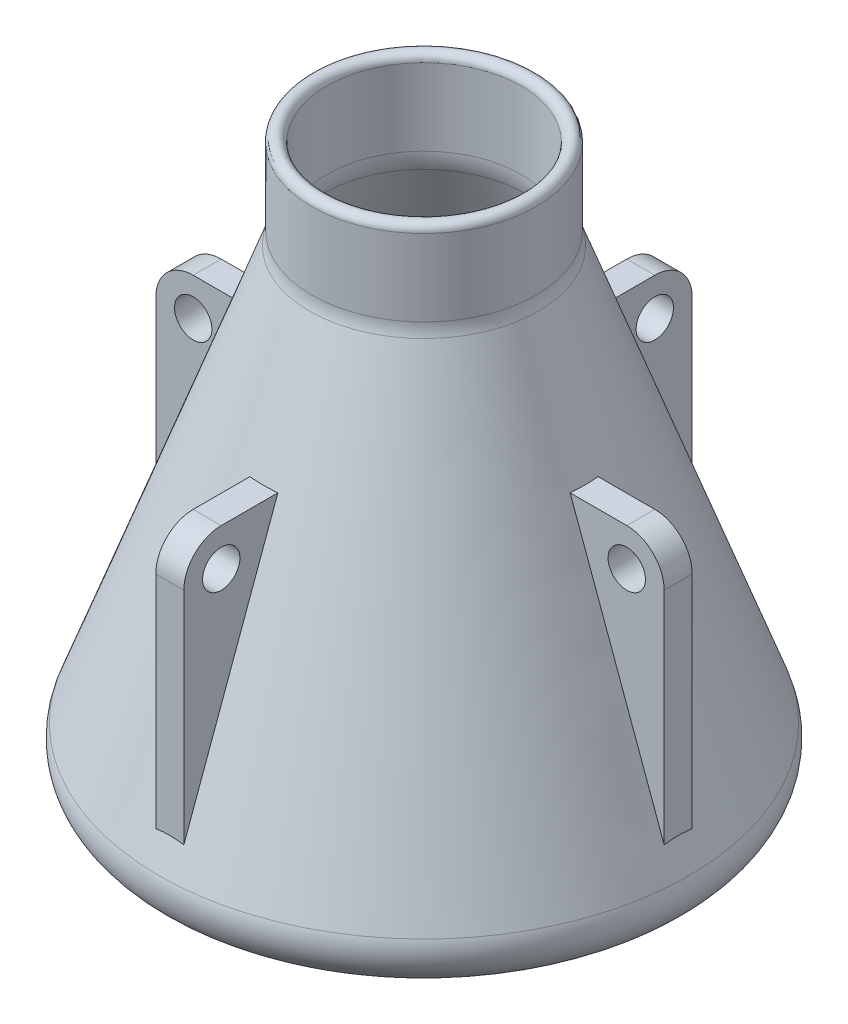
ISO-10303-21;
HEADER;
FILE_DESCRIPTION(('STEP AP214'),'2;1');
FILE_NAME('part.step','',(''),(''),'','','');
FILE_SCHEMA(('AUTOMOTIVE_DESIGN { 1 0 10303 214 1 1 1 1 }'));
ENDSEC;
DATA;
#1=APPLICATION_CONTEXT('core data for automotive mechanical design processes');
#2=APPLICATION_PROTOCOL_DEFINITION('international standard','automotive_design',2000,#1);
#3=PRODUCT_CONTEXT('',#1,'mechanical');
#4=PRODUCT('Part','Part','',(#3));
#5=PRODUCT_RELATED_PRODUCT_CATEGORY('part','',(#4));
#6=PRODUCT_DEFINITION_FORMATION('','',#4);
#7=PRODUCT_DEFINITION_CONTEXT('part definition',#1,'design');
#8=PRODUCT_DEFINITION('design','',#6,#7);
#9=PRODUCT_DEFINITION_SHAPE('','',#8);
#10=(LENGTH_UNIT() NAMED_UNIT(*) SI_UNIT(.MILLI.,.METRE.));
#11=(NAMED_UNIT(*) PLANE_ANGLE_UNIT() SI_UNIT($,.RADIAN.));
#12=(NAMED_UNIT(*) SI_UNIT($,.STERADIAN.) SOLID_ANGLE_UNIT());
#13=UNCERTAINTY_MEASURE_WITH_UNIT(LENGTH_MEASURE(1.E-05),#10,'distance_accuracy_value','');
#14=(GEOMETRIC_REPRESENTATION_CONTEXT(3) GLOBAL_UNCERTAINTY_ASSIGNED_CONTEXT((#13)) GLOBAL_UNIT_ASSIGNED_CONTEXT((#10,
#11,#12)) REPRESENTATION_CONTEXT('',''));
#15=CARTESIAN_POINT('',(0.,0.,0.));
#16=DIRECTION('',(0.,0.,1.));
#17=DIRECTION('',(1.,0.,0.));
#18=AXIS2_PLACEMENT_3D('',#15,#16,#17);
#19=CARTESIAN_POINT('',(0.,296.,0.));
#20=DIRECTION('',(0.,1.,0.));
#21=DIRECTION('',(0.,0.,1.));
#22=AXIS2_PLACEMENT_3D('',#19,#20,#21);
#23=TOROIDAL_SURFACE('',#22,56.,4.);
#24=CARTESIAN_POINT('',(0.,296.,0.));
#25=DIRECTION('',(0.,1.,0.));
#26=DIRECTION('',(0.,0.,1.));
#27=AXIS2_PLACEMENT_3D('',#24,#25,#26);
#28=CIRCLE('',#27,60.);
#29=CARTESIAN_POINT('',(0.,296.,60.));
#30=VERTEX_POINT('',#29);
#31=EDGE_CURVE('E263',#30,#30,#28,.F.);
#32=ORIENTED_EDGE('',*,*,#31,.F.);
#33=EDGE_LOOP('',(#32));
#34=FACE_BOUND('',#33,.T.);
#35=CARTESIAN_POINT('',(0.,296.,0.));
#36=DIRECTION('',(0.,1.,0.));
#37=DIRECTION('',(0.,0.,1.));
#38=AXIS2_PLACEMENT_3D('',#35,#36,#37);
#39=CIRCLE('',#38,52.);
#40=CARTESIAN_POINT('',(0.,296.,52.));
#41=VERTEX_POINT('',#40);
#42=EDGE_CURVE('E266',#41,#41,#39,.T.);
#43=ORIENTED_EDGE('',*,*,#42,.F.);
#44=EDGE_LOOP('',(#43));
#45=FACE_BOUND('',#44,.T.);
#46=ADVANCED_FACE('F37',(#34,#45),#23,.T.);
#47=CARTESIAN_POINT('',(0.,0.,0.));
#48=DIRECTION('',(0.,-1.,0.));
#49=DIRECTION('',(0.,0.,-1.));
#50=AXIS2_PLACEMENT_3D('',#47,#48,#49);
#51=PLANE('',#50);
#52=CARTESIAN_POINT('',(0.,0.,0.));
#53=DIRECTION('',(0.,1.,0.));
#54=DIRECTION('',(0.,0.,1.));
#55=AXIS2_PLACEMENT_3D('',#52,#53,#54);
#56=CIRCLE('',#55,122.965894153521);
#57=CARTESIAN_POINT('',(0.,0.,122.965894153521));
#58=VERTEX_POINT('',#57);
#59=EDGE_CURVE('E272',#58,#58,#56,.T.);
#60=ORIENTED_EDGE('',*,*,#59,.F.);
#61=EDGE_LOOP('',(#60));
#62=FACE_BOUND('',#61,.T.);
#63=ADVANCED_FACE('F253',(#62),#51,.T.);
#64=CARTESIAN_POINT('',(0.,20.,0.));
#65=DIRECTION('',(0.,1.,0.));
#66=DIRECTION('',(0.,0.,1.));
#67=AXIS2_PLACEMENT_3D('',#64,#65,#66);
#68=TOROIDAL_SURFACE('',#67,122.965894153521,20.);
#69=ORIENTED_EDGE('',*,*,#59,.T.);
#70=EDGE_LOOP('',(#69));
#71=FACE_BOUND('',#70,.T.);
#72=CARTESIAN_POINT('',(0.,26.8404028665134,0.));
#73=DIRECTION('',(0.,1.,0.));
#74=DIRECTION('',(0.,0.,1.));
#75=AXIS2_PLACEMENT_3D('',#72,#73,#74);
#76=CIRCLE('',#75,141.759746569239);
#77=CARTESIAN_POINT('',(0.,26.8404028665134,141.759746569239));
#78=VERTEX_POINT('',#77);
#79=EDGE_CURVE('E340',#78,#78,#76,.T.);
#80=ORIENTED_EDGE('',*,*,#79,.F.);
#81=EDGE_LOOP('',(#80));
#82=FACE_BOUND('',#81,.T.);
#83=ADVANCED_FACE('F258',(#71,#82),#68,.T.);
#84=CARTESIAN_POINT('',(0.,248.159597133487,0.));
#85=DIRECTION('',(0.,-1.,0.));
#86=DIRECTION('',(0.,0.,-1.));
#87=AXIS2_PLACEMENT_3D('',#84,#85,#86);
#88=CONICAL_SURFACE('',#87,61.2061475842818,0.349065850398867);
#89=ORIENTED_EDGE('',*,*,#79,.T.);
#90=EDGE_LOOP('',(#89));
#91=FACE_BOUND('',#90,.T.);
#92=CARTESIAN_POINT('',(-40.5536519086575,26.3693476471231,136.014212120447));
#93=CARTESIAN_POINT('',(-39.8157928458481,26.948561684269,136.014212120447));
#94=CARTESIAN_POINT('',(-39.0708739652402,27.5188535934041,136.014212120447));
#95=CARTESIAN_POINT('',(-37.566264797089,28.6398501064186,136.014212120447));
#96=CARTESIAN_POINT('',(-36.8065721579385,29.1905515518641,136.014212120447));
#97=CARTESIAN_POINT('',(-35.270423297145,30.2715466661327,136.014212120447));
#98=CARTESIAN_POINT('',(-34.4939358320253,30.8017960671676,136.014212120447));
#99=CARTESIAN_POINT('',(-32.9253421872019,31.8385351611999,136.014212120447));
#100=CARTESIAN_POINT('',(-32.1332366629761,32.34502584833,136.014212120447));
#101=CARTESIAN_POINT('',(-29.7097578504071,33.8397701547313,136.014212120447));
#102=CARTESIAN_POINT('',(-28.0531347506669,34.7877178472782,136.014212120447));
#103=CARTESIAN_POINT('',(-24.6735170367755,36.5545280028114,136.014212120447));
#104=CARTESIAN_POINT('',(-22.9505754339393,37.3734910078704,136.014212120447));
#105=CARTESIAN_POINT('',(-19.7794476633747,38.7149809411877,136.014212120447));
#106=CARTESIAN_POINT('',(-18.3425894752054,39.2642053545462,136.014212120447));
#107=CARTESIAN_POINT('',(-15.4301811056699,40.2500690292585,136.014212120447));
#108=CARTESIAN_POINT('',(-13.9546237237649,40.6866871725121,136.014212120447));
#109=CARTESIAN_POINT('',(-10.9808594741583,41.432170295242,136.014212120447));
#110=CARTESIAN_POINT('',(-9.48285102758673,41.7418143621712,136.014212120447));
#111=CARTESIAN_POINT('',(-7.22050122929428,42.1056591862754,136.014212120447));
#112=CARTESIAN_POINT('',(-6.46397867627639,42.2101599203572,136.014212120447));
#113=CARTESIAN_POINT('',(-4.94700851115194,42.3848257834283,136.014212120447));
#114=CARTESIAN_POINT('',(-4.18656143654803,42.4549954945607,136.014212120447));
#115=CARTESIAN_POINT('',(-2.85500057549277,42.5470929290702,136.014212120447));
#116=CARTESIAN_POINT('',(-2.28440498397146,42.5767174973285,136.014212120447));
#117=CARTESIAN_POINT('',(-1.14254537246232,42.6162359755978,136.014212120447));
#118=CARTESIAN_POINT('',(-0.571281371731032,42.6261304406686,136.014212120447));
#119=CARTESIAN_POINT('',(0.783897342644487,42.6261270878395,136.014212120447));
#120=CARTESIAN_POINT('',(1.56782739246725,42.6074925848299,136.014212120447));
#121=CARTESIAN_POINT('',(3.13401269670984,42.5331323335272,136.014212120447));
#122=CARTESIAN_POINT('',(3.91626769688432,42.4774013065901,136.014212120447));
#123=CARTESIAN_POINT('',(5.47778816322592,42.3293372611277,136.014212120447));
#124=CARTESIAN_POINT('',(6.25705156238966,42.2369823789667,136.014212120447));
#125=CARTESIAN_POINT('',(7.81054158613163,42.0165657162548,136.014212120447));
#126=CARTESIAN_POINT('',(8.5847675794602,41.8884995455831,136.014212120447));
#127=CARTESIAN_POINT('',(10.9085762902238,41.4503182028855,136.014212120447));
#128=CARTESIAN_POINT('',(12.4484698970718,41.087267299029,136.014212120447));
#129=CARTESIAN_POINT('',(15.4913189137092,40.2331562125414,136.014212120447));
#130=CARTESIAN_POINT('',(16.9942817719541,39.7421220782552,136.014212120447));
#131=CARTESIAN_POINT('',(20.4953428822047,38.4473257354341,136.014212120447));
#132=CARTESIAN_POINT('',(22.4754036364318,37.5947264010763,136.014212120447));
#133=CARTESIAN_POINT('',(26.3519676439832,35.713250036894,136.014212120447));
#134=CARTESIAN_POINT('',(28.2483576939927,34.6841428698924,136.014212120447));
#135=CARTESIAN_POINT('',(31.0139284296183,33.0422401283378,136.014212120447));
#136=CARTESIAN_POINT('',(31.9157464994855,32.4833903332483,136.014212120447));
#137=CARTESIAN_POINT('',(33.6993264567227,31.3343495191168,136.014212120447));
#138=CARTESIAN_POINT('',(34.5810870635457,30.7441565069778,136.014212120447));
#139=CARTESIAN_POINT('',(36.3222094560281,29.5375750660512,136.014212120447));
#140=CARTESIAN_POINT('',(37.1816344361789,28.9212774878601,136.014212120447));
#141=CARTESIAN_POINT('',(38.881577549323,27.6635351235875,136.014212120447));
#142=CARTESIAN_POINT('',(39.7221001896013,27.0220964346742,136.014212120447));
#143=CARTESIAN_POINT('',(40.5536519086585,26.369347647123,136.014212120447));
#144=B_SPLINE_CURVE_WITH_KNOTS('',3,(#92,#93,#94,#95,#96,#97,#98,#99,#100,#101,#102,#103,#104,
#105,#106,#107,#108,#109,#110,#111,#112,#113,#114,#115,#116,#117,#118,#119,#120,#121,#122,#123,
#124,#125,#126,#127,#128,#129,#130,#131,#132,#133,#134,#135,#136,#137,#138,#139,#140,#141,#142,
#143),.UNSPECIFIED.,.F.,.F.,(4,2,2,2,2,2,2,2,2,2,2,2,2,2,2,2,2,2,2,2,2,2,2,2,2,4),(0.,
2.81412235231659,5.62869636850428,8.44905485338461,11.2692952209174,16.9902890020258,
22.7068010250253,27.3174254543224,31.9289139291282,36.5116678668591,38.8021444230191,
41.0923151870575,42.8060870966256,44.5198107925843,46.8713375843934,49.2231990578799,
51.5764666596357,53.930023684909,58.6696277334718,63.4082678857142,69.8648672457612,
76.3299498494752,79.5122447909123,82.6947423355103,85.8669517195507,89.0383964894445),.UNSPECIFIED.);
#145=CARTESIAN_POINT('',(-7.49999999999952,42.058437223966,136.014212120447));
#146=VERTEX_POINT('',#145);
#147=CARTESIAN_POINT('',(7.50000000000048,42.058437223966,136.014212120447));
#148=VERTEX_POINT('',#147);
#149=EDGE_CURVE('E270',#146,#148,#144,.T.);
#150=ORIENTED_EDGE('',*,*,#149,.F.);
#151=CARTESIAN_POINT('',(-7.49999999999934,-101.056820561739,188.161115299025));
#152=CARTESIAN_POINT('',(-7.49999999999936,-86.5010227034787,182.859014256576));
#153=CARTESIAN_POINT('',(-7.49999999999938,-71.9453288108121,177.556627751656));
#154=CARTESIAN_POINT('',(-7.49999999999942,-42.8342418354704,166.951029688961));
#155=CARTESIAN_POINT('',(-7.49999999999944,-28.2788487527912,161.647818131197));
#156=CARTESIAN_POINT('',(-7.49999999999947,0.831600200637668,151.040295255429));
#157=CARTESIAN_POINT('',(-7.49999999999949,15.3866560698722,145.735983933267));
#158=CARTESIAN_POINT('',(-7.49999999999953,44.4962248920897,135.125870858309));
#159=CARTESIAN_POINT('',(-7.49999999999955,59.0507378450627,129.820069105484));
#160=CARTESIAN_POINT('',(-7.49999999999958,88.1589828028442,119.206332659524));
#161=CARTESIAN_POINT('',(-7.4999999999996,102.712714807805,113.898397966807));
#162=CARTESIAN_POINT('',(-7.49999999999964,131.81901789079,103.279348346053));
#163=CARTESIAN_POINT('',(-7.49999999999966,146.371588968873,97.9682334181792));
#164=CARTESIAN_POINT('',(-7.49999999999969,168.199012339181,89.9977030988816));
#165=CARTESIAN_POINT('',(-7.49999999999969,175.474570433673,87.3402206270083));
#166=CARTESIAN_POINT('',(-7.49999999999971,190.025062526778,82.0235477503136));
#167=CARTESIAN_POINT('',(-7.49999999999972,197.299996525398,79.3643573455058));
#168=CARTESIAN_POINT('',(-7.49999999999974,211.849030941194,74.0436899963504));
#169=CARTESIAN_POINT('',(-7.49999999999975,219.123131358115,71.3822130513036));
#170=CARTESIAN_POINT('',(-7.49999999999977,233.670170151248,66.0560854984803));
#171=CARTESIAN_POINT('',(-7.49999999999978,240.943108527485,63.3914348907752));
#172=CARTESIAN_POINT('',(-7.4999999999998,255.20721151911,58.1602910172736));
#173=CARTESIAN_POINT('',(-7.49999999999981,262.198439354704,55.5939702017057));
#174=CARTESIAN_POINT('',(-7.49999999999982,272.683522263,51.739713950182));
#175=CARTESIAN_POINT('',(-7.49999999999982,276.178255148,50.4541666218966));
#176=CARTESIAN_POINT('',(-7.49999999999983,283.16698024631,47.8810584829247));
#177=CARTESIAN_POINT('',(-7.49999999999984,286.660972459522,46.5934976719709));
#178=CARTESIAN_POINT('',(-7.49999999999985,293.648024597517,44.0158069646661));
#179=CARTESIAN_POINT('',(-7.49999999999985,297.141084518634,42.7256770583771));
#180=CARTESIAN_POINT('',(-7.49999999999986,304.12596845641,40.1420784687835));
#181=CARTESIAN_POINT('',(-7.49999999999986,307.617792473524,38.8486097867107));
#182=CARTESIAN_POINT('',(-7.49999999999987,312.854284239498,36.9050385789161));
#183=CARTESIAN_POINT('',(-7.49999999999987,314.599576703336,36.2566191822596));
#184=CARTESIAN_POINT('',(-7.49999999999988,318.089669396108,34.9584574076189));
#185=CARTESIAN_POINT('',(-7.49999999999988,319.834469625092,34.3087150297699));
#186=CARTESIAN_POINT('',(-7.49999999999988,323.32349173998,33.007672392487));
#187=CARTESIAN_POINT('',(-7.49999999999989,325.067713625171,32.3563721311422));
#188=CARTESIAN_POINT('',(-7.49999999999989,328.555455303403,31.0518927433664));
#189=CARTESIAN_POINT('',(-7.49999999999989,330.298975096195,30.3987136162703));
#190=CARTESIAN_POINT('',(-7.4999999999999,332.042082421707,29.7444343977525));
#191=B_SPLINE_CURVE_WITH_KNOTS('',3,(#151,#152,#153,#154,#155,#156,#157,#158,#159,#160,#161,
#162,#163,#164,#165,#166,#167,#168,#169,#170,#171,#172,#173,#174,#175,#176,#177,#178,#179,#180,
#181,#182,#183,#184,#185,#186,#187,#188,#189,#190),.UNSPECIFIED.,.F.,.F.,(4,2,2,2,2,2,2,2,2,2,2,
2,2,2,2,2,2,2,2,4),(0.,46.474205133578,92.9484096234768,139.422793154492,185.897177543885,
232.371552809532,278.845925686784,302.083042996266,325.320160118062,348.557284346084,
371.794408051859,394.136505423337,405.307543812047,416.478583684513,427.649666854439,
438.820745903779,444.406301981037,449.991857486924,455.577419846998,461.162984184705),.UNSPECIFIED.);
#192=CARTESIAN_POINT('',(-7.4999999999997,180.,85.6866073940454));
#193=VERTEX_POINT('',#192);
#194=EDGE_CURVE('E432',#146,#193,#191,.T.);
#195=ORIENTED_EDGE('',*,*,#194,.T.);
#196=CARTESIAN_POINT('',(0.,180.,1.55085025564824E-13));
#197=DIRECTION('',(0.,1.,0.));
#198=DIRECTION('',(0.,0.,1.));
#199=AXIS2_PLACEMENT_3D('',#196,#197,#198);
#200=CIRCLE('',#199,86.014212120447);
#201=CARTESIAN_POINT('',(7.5000000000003,180.,85.6866073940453));
#202=VERTEX_POINT('',#201);
#203=EDGE_CURVE('E431',#202,#193,#200,.F.);
#204=ORIENTED_EDGE('',*,*,#203,.F.);
#205=CARTESIAN_POINT('',(7.50000000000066,-101.056820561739,188.161115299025));
#206=CARTESIAN_POINT('',(7.50000000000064,-86.5010227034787,182.859014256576));
#207=CARTESIAN_POINT('',(7.50000000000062,-71.9453288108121,177.556627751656));
#208=CARTESIAN_POINT('',(7.50000000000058,-42.8342418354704,166.951029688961));
#209=CARTESIAN_POINT('',(7.50000000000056,-28.2788487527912,161.647818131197));
#210=CARTESIAN_POINT('',(7.50000000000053,0.831600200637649,151.040295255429));
#211=CARTESIAN_POINT('',(7.50000000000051,15.3866560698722,145.735983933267));
#212=CARTESIAN_POINT('',(7.50000000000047,44.4962248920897,135.125870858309));
#213=CARTESIAN_POINT('',(7.50000000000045,59.0507378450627,129.820069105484));
#214=CARTESIAN_POINT('',(7.50000000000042,88.1589828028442,119.206332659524));
#215=CARTESIAN_POINT('',(7.5000000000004,102.712714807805,113.898397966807));
#216=CARTESIAN_POINT('',(7.50000000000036,131.81901789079,103.279348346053));
#217=CARTESIAN_POINT('',(7.50000000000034,146.371588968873,97.9682334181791));
#218=CARTESIAN_POINT('',(7.50000000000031,168.199012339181,89.9977030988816));
#219=CARTESIAN_POINT('',(7.5000000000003,175.474570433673,87.3402206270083));
#220=CARTESIAN_POINT('',(7.50000000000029,190.025062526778,82.0235477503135));
#221=CARTESIAN_POINT('',(7.50000000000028,197.299996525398,79.3643573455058));
#222=CARTESIAN_POINT('',(7.50000000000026,211.849030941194,74.0436899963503));
#223=CARTESIAN_POINT('',(7.50000000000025,219.123131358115,71.3822130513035));
#224=CARTESIAN_POINT('',(7.50000000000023,233.670170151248,66.0560854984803));
#225=CARTESIAN_POINT('',(7.50000000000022,240.943108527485,63.3914348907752));
#226=CARTESIAN_POINT('',(7.5000000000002,255.20721151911,58.1602910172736));
#227=CARTESIAN_POINT('',(7.50000000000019,262.198439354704,55.5939702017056));
#228=CARTESIAN_POINT('',(7.50000000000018,272.683522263,51.739713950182));
#229=CARTESIAN_POINT('',(7.50000000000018,276.178255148,50.4541666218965));
#230=CARTESIAN_POINT('',(7.50000000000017,283.16698024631,47.8810584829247));
#231=CARTESIAN_POINT('',(7.50000000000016,286.660972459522,46.5934976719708));
#232=CARTESIAN_POINT('',(7.50000000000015,293.648024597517,44.015806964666));
#233=CARTESIAN_POINT('',(7.50000000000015,297.141084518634,42.725677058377));
#234=CARTESIAN_POINT('',(7.50000000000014,304.12596845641,40.1420784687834));
#235=CARTESIAN_POINT('',(7.50000000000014,307.617792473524,38.8486097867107));
#236=CARTESIAN_POINT('',(7.50000000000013,312.854284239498,36.905038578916));
#237=CARTESIAN_POINT('',(7.50000000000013,314.599576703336,36.2566191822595));
#238=CARTESIAN_POINT('',(7.50000000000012,318.089669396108,34.9584574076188));
#239=CARTESIAN_POINT('',(7.50000000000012,319.834469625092,34.3087150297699));
#240=CARTESIAN_POINT('',(7.50000000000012,323.32349173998,33.007672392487));
#241=CARTESIAN_POINT('',(7.50000000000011,325.067713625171,32.3563721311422));
#242=CARTESIAN_POINT('',(7.50000000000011,328.555455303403,31.0518927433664));
#243=CARTESIAN_POINT('',(7.50000000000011,330.298975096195,30.3987136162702));
#244=CARTESIAN_POINT('',(7.5000000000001,332.042082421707,29.7444343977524));
#245=B_SPLINE_CURVE_WITH_KNOTS('',3,(#205,#206,#207,#208,#209,#210,#211,#212,#213,#214,#215,
#216,#217,#218,#219,#220,#221,#222,#223,#224,#225,#226,#227,#228,#229,#230,#231,#232,#233,#234,
#235,#236,#237,#238,#239,#240,#241,#242,#243,#244),.UNSPECIFIED.,.F.,.F.,(4,2,2,2,2,2,2,2,2,2,2,
2,2,2,2,2,2,2,2,4),(0.,46.474205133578,92.9484096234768,139.422793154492,185.897177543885,
232.371552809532,278.845925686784,302.083042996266,325.320160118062,348.557284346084,
371.794408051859,394.136505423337,405.307543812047,416.478583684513,427.649666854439,
438.820745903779,444.406301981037,449.991857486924,455.577419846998,461.162984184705),.UNSPECIFIED.);
#246=EDGE_CURVE('E424',#148,#202,#245,.T.);
#247=ORIENTED_EDGE('',*,*,#246,.F.);
#248=EDGE_LOOP('',(#150,#195,#204,#247));
#249=FACE_BOUND('',#248,.T.);
#250=CARTESIAN_POINT('',(-7.50000000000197,-101.056820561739,-188.161115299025));
#251=CARTESIAN_POINT('',(-7.50000000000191,-86.5010227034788,-182.859014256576));
#252=CARTESIAN_POINT('',(-7.50000000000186,-71.9453288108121,-177.556627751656));
#253=CARTESIAN_POINT('',(-7.50000000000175,-42.8342418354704,-166.951029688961));
#254=CARTESIAN_POINT('',(-7.50000000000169,-28.2788487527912,-161.647818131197));
#255=CARTESIAN_POINT('',(-7.50000000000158,0.831600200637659,-151.040295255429));
#256=CARTESIAN_POINT('',(-7.50000000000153,15.3866560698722,-145.735983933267));
#257=CARTESIAN_POINT('',(-7.50000000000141,44.4962248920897,-135.125870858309));
#258=CARTESIAN_POINT('',(-7.50000000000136,59.0507378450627,-129.820069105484));
#259=CARTESIAN_POINT('',(-7.50000000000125,88.1589828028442,-119.206332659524));
#260=CARTESIAN_POINT('',(-7.50000000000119,102.712714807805,-113.898397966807));
#261=CARTESIAN_POINT('',(-7.50000000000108,131.81901789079,-103.279348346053));
#262=CARTESIAN_POINT('',(-7.50000000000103,146.371588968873,-97.9682334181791));
#263=CARTESIAN_POINT('',(-7.50000000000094,168.199012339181,-89.9977030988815));
#264=CARTESIAN_POINT('',(-7.50000000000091,175.474570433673,-87.3402206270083));
#265=CARTESIAN_POINT('',(-7.50000000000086,190.025062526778,-82.0235477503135));
#266=CARTESIAN_POINT('',(-7.50000000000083,197.299996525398,-79.3643573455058));
#267=CARTESIAN_POINT('',(-7.50000000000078,211.849030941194,-74.0436899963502));
#268=CARTESIAN_POINT('',(-7.50000000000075,219.123131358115,-71.3822130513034));
#269=CARTESIAN_POINT('',(-7.50000000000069,233.670170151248,-66.0560854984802));
#270=CARTESIAN_POINT('',(-7.50000000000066,240.943108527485,-63.3914348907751));
#271=CARTESIAN_POINT('',(-7.50000000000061,255.20721151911,-58.1602910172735));
#272=CARTESIAN_POINT('',(-7.50000000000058,262.198439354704,-55.5939702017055));
#273=CARTESIAN_POINT('',(-7.50000000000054,272.683522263,-51.7397139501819));
#274=CARTESIAN_POINT('',(-7.50000000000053,276.178255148,-50.4541666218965));
#275=CARTESIAN_POINT('',(-7.5000000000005,283.16698024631,-47.8810584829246));
#276=CARTESIAN_POINT('',(-7.50000000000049,286.660972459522,-46.5934976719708));
#277=CARTESIAN_POINT('',(-7.50000000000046,293.648024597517,-44.015806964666));
#278=CARTESIAN_POINT('',(-7.50000000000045,297.141084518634,-42.725677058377));
#279=CARTESIAN_POINT('',(-7.50000000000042,304.12596845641,-40.1420784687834));
#280=CARTESIAN_POINT('',(-7.50000000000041,307.617792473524,-38.8486097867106));
#281=CARTESIAN_POINT('',(-7.50000000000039,312.854284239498,-36.9050385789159));
#282=CARTESIAN_POINT('',(-7.50000000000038,314.599576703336,-36.2566191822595));
#283=CARTESIAN_POINT('',(-7.50000000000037,318.089669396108,-34.9584574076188));
#284=CARTESIAN_POINT('',(-7.50000000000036,319.834469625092,-34.3087150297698));
#285=CARTESIAN_POINT('',(-7.50000000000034,323.32349173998,-33.0076723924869));
#286=CARTESIAN_POINT('',(-7.50000000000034,325.067713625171,-32.3563721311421));
#287=CARTESIAN_POINT('',(-7.50000000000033,328.555455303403,-31.0518927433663));
#288=CARTESIAN_POINT('',(-7.50000000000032,330.298975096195,-30.3987136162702));
#289=CARTESIAN_POINT('',(-7.50000000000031,332.042082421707,-29.7444343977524));
#290=B_SPLINE_CURVE_WITH_KNOTS('',3,(#250,#251,#252,#253,#254,#255,#256,#257,#258,#259,#260,
#261,#262,#263,#264,#265,#266,#267,#268,#269,#270,#271,#272,#273,#274,#275,#276,#277,#278,#279,
#280,#281,#282,#283,#284,#285,#286,#287,#288,#289),.UNSPECIFIED.,.F.,.F.,(4,2,2,2,2,2,2,2,2,2,2,
2,2,2,2,2,2,2,2,4),(0.,46.474205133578,92.9484096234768,139.422793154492,185.897177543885,
232.371552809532,278.845925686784,302.083042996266,325.320160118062,348.557284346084,
371.794408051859,394.136505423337,405.307543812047,416.478583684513,427.649666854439,
438.820745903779,444.406301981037,449.991857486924,455.577419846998,461.162984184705),.UNSPECIFIED.);
#291=CARTESIAN_POINT('',(-7.50000000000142,42.058437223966,-136.014212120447));
#292=VERTEX_POINT('',#291);
#293=CARTESIAN_POINT('',(-7.5000000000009,180.,-85.6866073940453));
#294=VERTEX_POINT('',#293);
#295=EDGE_CURVE('E194',#292,#294,#290,.T.);
#296=ORIENTED_EDGE('',*,*,#295,.F.);
#297=CARTESIAN_POINT('',(40.5536519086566,26.369347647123,-136.014212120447));
#298=CARTESIAN_POINT('',(39.8157928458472,26.948561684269,-136.014212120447));
#299=CARTESIAN_POINT('',(39.0708739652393,27.5188535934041,-136.014212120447));
#300=CARTESIAN_POINT('',(37.5662647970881,28.6398501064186,-136.014212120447));
#301=CARTESIAN_POINT('',(36.8065721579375,29.190551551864,-136.014212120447));
#302=CARTESIAN_POINT('',(35.2704232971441,30.2715466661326,-136.014212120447));
#303=CARTESIAN_POINT('',(34.4939358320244,30.8017960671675,-136.014212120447));
#304=CARTESIAN_POINT('',(32.925342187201,31.8385351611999,-136.014212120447));
#305=CARTESIAN_POINT('',(32.1332366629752,32.3450258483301,-136.014212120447));
#306=CARTESIAN_POINT('',(29.7097578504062,33.8397701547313,-136.014212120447));
#307=CARTESIAN_POINT('',(28.053134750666,34.7877178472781,-136.014212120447));
#308=CARTESIAN_POINT('',(24.6735170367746,36.5545280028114,-136.014212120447));
#309=CARTESIAN_POINT('',(22.9505754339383,37.3734910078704,-136.014212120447));
#310=CARTESIAN_POINT('',(19.7794476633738,38.7149809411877,-136.014212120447));
#311=CARTESIAN_POINT('',(18.3425894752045,39.2642053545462,-136.014212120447));
#312=CARTESIAN_POINT('',(15.430181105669,40.2500690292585,-136.014212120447));
#313=CARTESIAN_POINT('',(13.954623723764,40.6866871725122,-136.014212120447));
#314=CARTESIAN_POINT('',(10.9808594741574,41.432170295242,-136.014212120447));
#315=CARTESIAN_POINT('',(9.48285102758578,41.7418143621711,-136.014212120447));
#316=CARTESIAN_POINT('',(7.22050122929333,42.1056591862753,-136.014212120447));
#317=CARTESIAN_POINT('',(6.46397867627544,42.2101599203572,-136.014212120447));
#318=CARTESIAN_POINT('',(4.947008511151,42.3848257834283,-136.014212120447));
#319=CARTESIAN_POINT('',(4.18656143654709,42.4549954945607,-136.014212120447));
#320=CARTESIAN_POINT('',(2.85500057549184,42.5470929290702,-136.014212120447));
#321=CARTESIAN_POINT('',(2.28440498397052,42.5767174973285,-136.014212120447));
#322=CARTESIAN_POINT('',(1.14254537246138,42.6162359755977,-136.014212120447));
#323=CARTESIAN_POINT('',(0.571281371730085,42.6261304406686,-136.014212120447));
#324=CARTESIAN_POINT('',(-0.783897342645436,42.6261270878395,-136.014212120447));
#325=CARTESIAN_POINT('',(-1.56782739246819,42.6074925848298,-136.014212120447));
#326=CARTESIAN_POINT('',(-3.13401269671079,42.5331323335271,-136.014212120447));
#327=CARTESIAN_POINT('',(-3.91626769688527,42.4774013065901,-136.014212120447));
#328=CARTESIAN_POINT('',(-5.47778816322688,42.3293372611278,-136.014212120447));
#329=CARTESIAN_POINT('',(-6.25705156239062,42.2369823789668,-136.014212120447));
#330=CARTESIAN_POINT('',(-7.81054158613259,42.0165657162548,-136.014212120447));
#331=CARTESIAN_POINT('',(-8.58476757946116,41.8884995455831,-136.014212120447));
#332=CARTESIAN_POINT('',(-10.9085762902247,41.4503182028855,-136.014212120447));
#333=CARTESIAN_POINT('',(-12.4484698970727,41.087267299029,-136.014212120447));
#334=CARTESIAN_POINT('',(-15.4913189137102,40.2331562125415,-136.014212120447));
#335=CARTESIAN_POINT('',(-16.994281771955,39.7421220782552,-136.014212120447));
#336=CARTESIAN_POINT('',(-20.4953428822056,38.4473257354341,-136.014212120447));
#337=CARTESIAN_POINT('',(-22.4754036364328,37.5947264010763,-136.014212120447));
#338=CARTESIAN_POINT('',(-26.3519676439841,35.7132500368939,-136.014212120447));
#339=CARTESIAN_POINT('',(-28.2483576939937,34.6841428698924,-136.014212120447));
#340=CARTESIAN_POINT('',(-31.0139284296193,33.0422401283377,-136.014212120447));
#341=CARTESIAN_POINT('',(-31.9157464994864,32.4833903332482,-136.014212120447));
#342=CARTESIAN_POINT('',(-33.6993264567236,31.3343495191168,-136.014212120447));
#343=CARTESIAN_POINT('',(-34.5810870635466,30.7441565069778,-136.014212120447));
#344=CARTESIAN_POINT('',(-36.322209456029,29.5375750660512,-136.014212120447));
#345=CARTESIAN_POINT('',(-37.1816344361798,28.9212774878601,-136.014212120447));
#346=CARTESIAN_POINT('',(-38.8815775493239,27.6635351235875,-136.014212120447));
#347=CARTESIAN_POINT('',(-39.7221001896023,27.0220964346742,-136.014212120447));
#348=CARTESIAN_POINT('',(-40.5536519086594,26.369347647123,-136.014212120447));
#349=B_SPLINE_CURVE_WITH_KNOTS('',3,(#297,#298,#299,#300,#301,#302,#303,#304,#305,#306,#307,
#308,#309,#310,#311,#312,#313,#314,#315,#316,#317,#318,#319,#320,#321,#322,#323,#324,#325,#326,
#327,#328,#329,#330,#331,#332,#333,#334,#335,#336,#337,#338,#339,#340,#341,#342,#343,#344,#345,
#346,#347,#348),.UNSPECIFIED.,.F.,.F.,(4,2,2,2,2,2,2,2,2,2,2,2,2,2,2,2,2,2,2,2,2,2,2,2,2,4),(0.,
2.81412235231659,5.62869636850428,8.44905485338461,11.2692952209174,16.9902890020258,
22.7068010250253,27.3174254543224,31.9289139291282,36.5116678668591,38.8021444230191,
41.0923151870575,42.8060870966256,44.5198107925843,46.8713375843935,49.2231990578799,
51.5764666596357,53.930023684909,58.6696277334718,63.4082678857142,69.8648672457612,
76.3299498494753,79.5122447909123,82.6947423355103,85.8669517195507,89.0383964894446),.UNSPECIFIED.);
#350=CARTESIAN_POINT('',(7.49999999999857,42.058437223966,-136.014212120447));
#351=VERTEX_POINT('',#350);
#352=EDGE_CURVE('E11',#351,#292,#349,.T.);
#353=ORIENTED_EDGE('',*,*,#352,.F.);
#354=CARTESIAN_POINT('',(7.49999999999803,-101.056820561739,-188.161115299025));
#355=CARTESIAN_POINT('',(7.49999999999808,-86.5010227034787,-182.859014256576));
#356=CARTESIAN_POINT('',(7.49999999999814,-71.9453288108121,-177.556627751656));
#357=CARTESIAN_POINT('',(7.49999999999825,-42.8342418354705,-166.951029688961));
#358=CARTESIAN_POINT('',(7.49999999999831,-28.2788487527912,-161.647818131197));
#359=CARTESIAN_POINT('',(7.49999999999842,0.831600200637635,-151.040295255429));
#360=CARTESIAN_POINT('',(7.49999999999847,15.3866560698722,-145.735983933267));
#361=CARTESIAN_POINT('',(7.49999999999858,44.4962248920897,-135.125870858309));
#362=CARTESIAN_POINT('',(7.49999999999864,59.0507378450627,-129.820069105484));
#363=CARTESIAN_POINT('',(7.49999999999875,88.1589828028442,-119.206332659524));
#364=CARTESIAN_POINT('',(7.49999999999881,102.712714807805,-113.898397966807));
#365=CARTESIAN_POINT('',(7.49999999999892,131.81901789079,-103.279348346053));
#366=CARTESIAN_POINT('',(7.49999999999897,146.371588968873,-97.9682334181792));
#367=CARTESIAN_POINT('',(7.49999999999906,168.199012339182,-89.9977030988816));
#368=CARTESIAN_POINT('',(7.49999999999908,175.474570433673,-87.3402206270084));
#369=CARTESIAN_POINT('',(7.49999999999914,190.025062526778,-82.0235477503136));
#370=CARTESIAN_POINT('',(7.49999999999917,197.299996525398,-79.3643573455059));
#371=CARTESIAN_POINT('',(7.49999999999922,211.849030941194,-74.0436899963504));
#372=CARTESIAN_POINT('',(7.49999999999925,219.123131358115,-71.3822130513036));
#373=CARTESIAN_POINT('',(7.49999999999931,233.670170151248,-66.0560854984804));
#374=CARTESIAN_POINT('',(7.49999999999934,240.943108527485,-63.3914348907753));
#375=CARTESIAN_POINT('',(7.49999999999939,255.20721151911,-58.1602910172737));
#376=CARTESIAN_POINT('',(7.49999999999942,262.198439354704,-55.5939702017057));
#377=CARTESIAN_POINT('',(7.49999999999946,272.683522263,-51.7397139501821));
#378=CARTESIAN_POINT('',(7.49999999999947,276.178255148,-50.4541666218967));
#379=CARTESIAN_POINT('',(7.4999999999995,283.16698024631,-47.8810584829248));
#380=CARTESIAN_POINT('',(7.49999999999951,286.660972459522,-46.593497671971));
#381=CARTESIAN_POINT('',(7.49999999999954,293.648024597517,-44.0158069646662));
#382=CARTESIAN_POINT('',(7.49999999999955,297.141084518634,-42.7256770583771));
#383=CARTESIAN_POINT('',(7.49999999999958,304.12596845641,-40.1420784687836));
#384=CARTESIAN_POINT('',(7.49999999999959,307.617792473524,-38.8486097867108));
#385=CARTESIAN_POINT('',(7.49999999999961,312.854284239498,-36.9050385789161));
#386=CARTESIAN_POINT('',(7.49999999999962,314.599576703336,-36.2566191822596));
#387=CARTESIAN_POINT('',(7.49999999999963,318.089669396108,-34.9584574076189));
#388=CARTESIAN_POINT('',(7.49999999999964,319.834469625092,-34.30871502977));
#389=CARTESIAN_POINT('',(7.49999999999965,323.32349173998,-33.007672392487));
#390=CARTESIAN_POINT('',(7.49999999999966,325.067713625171,-32.3563721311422));
#391=CARTESIAN_POINT('',(7.49999999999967,328.555455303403,-31.0518927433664));
#392=CARTESIAN_POINT('',(7.49999999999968,330.298975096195,-30.3987136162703));
#393=CARTESIAN_POINT('',(7.49999999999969,332.042082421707,-29.7444343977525));
#394=B_SPLINE_CURVE_WITH_KNOTS('',3,(#354,#355,#356,#357,#358,#359,#360,#361,#362,#363,#364,
#365,#366,#367,#368,#369,#370,#371,#372,#373,#374,#375,#376,#377,#378,#379,#380,#381,#382,#383,
#384,#385,#386,#387,#388,#389,#390,#391,#392,#393),.UNSPECIFIED.,.F.,.F.,(4,2,2,2,2,2,2,2,2,2,2,
2,2,2,2,2,2,2,2,4),(0.,46.474205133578,92.9484096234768,139.422793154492,185.897177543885,
232.371552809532,278.845925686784,302.083042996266,325.320160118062,348.557284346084,
371.794408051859,394.136505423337,405.307543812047,416.478583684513,427.649666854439,
438.820745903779,444.406301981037,449.991857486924,455.577419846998,461.162984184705),.UNSPECIFIED.);
#395=CARTESIAN_POINT('',(7.4999999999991,180.,-85.6866073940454));
#396=VERTEX_POINT('',#395);
#397=EDGE_CURVE('E185',#351,#396,#394,.T.);
#398=ORIENTED_EDGE('',*,*,#397,.T.);
#399=CARTESIAN_POINT('',(0.,180.,-1.55085025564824E-13));
#400=DIRECTION('',(0.,1.,0.));
#401=DIRECTION('',(0.,0.,1.));
#402=AXIS2_PLACEMENT_3D('',#399,#400,#401);
#403=CIRCLE('',#402,86.014212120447);
#404=EDGE_CURVE('E514',#294,#396,#403,.F.);
#405=ORIENTED_EDGE('',*,*,#404,.F.);
#406=EDGE_LOOP('',(#296,#353,#398,#405));
#407=FACE_BOUND('',#406,.T.);
#408=CARTESIAN_POINT('',(-136.014212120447,26.3693476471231,-40.553651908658));
#409=CARTESIAN_POINT('',(-136.014212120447,26.948561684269,-39.8157928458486));
#410=CARTESIAN_POINT('',(-136.014212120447,27.5188535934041,-39.0708739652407));
#411=CARTESIAN_POINT('',(-136.014212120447,28.6398501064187,-37.5662647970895));
#412=CARTESIAN_POINT('',(-136.014212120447,29.1905515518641,-36.8065721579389));
#413=CARTESIAN_POINT('',(-136.014212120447,30.2715466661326,-35.2704232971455));
#414=CARTESIAN_POINT('',(-136.014212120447,30.8017960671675,-34.4939358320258));
#415=CARTESIAN_POINT('',(-136.014212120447,31.8385351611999,-32.9253421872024));
#416=CARTESIAN_POINT('',(-136.014212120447,32.34502584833,-32.1332366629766));
#417=CARTESIAN_POINT('',(-136.014212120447,33.8397701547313,-29.7097578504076));
#418=CARTESIAN_POINT('',(-136.014212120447,34.7877178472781,-28.0531347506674));
#419=CARTESIAN_POINT('',(-136.014212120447,36.5545280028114,-24.673517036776));
#420=CARTESIAN_POINT('',(-136.014212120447,37.3734910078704,-22.9505754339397));
#421=CARTESIAN_POINT('',(-136.014212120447,38.7149809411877,-19.7794476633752));
#422=CARTESIAN_POINT('',(-136.014212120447,39.2642053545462,-18.3425894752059));
#423=CARTESIAN_POINT('',(-136.014212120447,40.2500690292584,-15.4301811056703));
#424=CARTESIAN_POINT('',(-136.014212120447,40.6866871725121,-13.9546237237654));
#425=CARTESIAN_POINT('',(-136.014212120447,41.432170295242,-10.9808594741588));
#426=CARTESIAN_POINT('',(-136.014212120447,41.7418143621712,-9.4828510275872));
#427=CARTESIAN_POINT('',(-136.014212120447,42.1056591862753,-7.22050122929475));
#428=CARTESIAN_POINT('',(-136.014212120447,42.2101599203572,-6.46397867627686));
#429=CARTESIAN_POINT('',(-136.014212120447,42.3848257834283,-4.94700851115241));
#430=CARTESIAN_POINT('',(-136.014212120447,42.4549954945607,-4.1865614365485));
#431=CARTESIAN_POINT('',(-136.014212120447,42.5470929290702,-2.85500057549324));
#432=CARTESIAN_POINT('',(-136.014212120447,42.5767174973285,-2.28440498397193));
#433=CARTESIAN_POINT('',(-136.014212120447,42.6162359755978,-1.1425453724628));
#434=CARTESIAN_POINT('',(-136.014212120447,42.6261304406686,-0.571281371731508));
#435=CARTESIAN_POINT('',(-136.014212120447,42.6261270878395,0.783897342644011));
#436=CARTESIAN_POINT('',(-136.014212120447,42.6074925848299,1.56782739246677));
#437=CARTESIAN_POINT('',(-136.014212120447,42.5331323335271,3.13401269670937));
#438=CARTESIAN_POINT('',(-136.014212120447,42.4774013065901,3.91626769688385));
#439=CARTESIAN_POINT('',(-136.014212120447,42.3293372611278,5.47778816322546));
#440=CARTESIAN_POINT('',(-136.014212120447,42.2369823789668,6.25705156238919));
#441=CARTESIAN_POINT('',(-136.014212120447,42.0165657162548,7.81054158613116));
#442=CARTESIAN_POINT('',(-136.014212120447,41.8884995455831,8.58476757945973));
#443=CARTESIAN_POINT('',(-136.014212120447,41.4503182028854,10.9085762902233));
#444=CARTESIAN_POINT('',(-136.014212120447,41.0872672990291,12.4484698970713));
#445=CARTESIAN_POINT('',(-136.014212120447,40.2331562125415,15.4913189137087));
#446=CARTESIAN_POINT('',(-136.014212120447,39.7421220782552,16.9942817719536));
#447=CARTESIAN_POINT('',(-136.014212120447,38.4473257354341,20.4953428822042));
#448=CARTESIAN_POINT('',(-136.014212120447,37.5947264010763,22.4754036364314));
#449=CARTESIAN_POINT('',(-136.014212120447,35.7132500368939,26.3519676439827));
#450=CARTESIAN_POINT('',(-136.014212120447,34.6841428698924,28.2483576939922));
#451=CARTESIAN_POINT('',(-136.014212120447,33.0422401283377,31.0139284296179));
#452=CARTESIAN_POINT('',(-136.014212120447,32.4833903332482,31.915746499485));
#453=CARTESIAN_POINT('',(-136.014212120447,31.3343495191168,33.6993264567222));
#454=CARTESIAN_POINT('',(-136.014212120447,30.7441565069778,34.5810870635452));
#455=CARTESIAN_POINT('',(-136.014212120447,29.5375750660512,36.3222094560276));
#456=CARTESIAN_POINT('',(-136.014212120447,28.9212774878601,37.1816344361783));
#457=CARTESIAN_POINT('',(-136.014212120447,27.6635351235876,38.8815775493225));
#458=CARTESIAN_POINT('',(-136.014212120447,27.0220964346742,39.7221001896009));
#459=CARTESIAN_POINT('',(-136.014212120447,26.3693476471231,40.553651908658));
#460=B_SPLINE_CURVE_WITH_KNOTS('',3,(#408,#409,#410,#411,#412,#413,#414,#415,#416,#417,#418,
#419,#420,#421,#422,#423,#424,#425,#426,#427,#428,#429,#430,#431,#432,#433,#434,#435,#436,#437,
#438,#439,#440,#441,#442,#443,#444,#445,#446,#447,#448,#449,#450,#451,#452,#453,#454,#455,#456,
#457,#458,#459),.UNSPECIFIED.,.F.,.F.,(4,2,2,2,2,2,2,2,2,2,2,2,2,2,2,2,2,2,2,2,2,2,2,2,2,4),(0.,
2.8141223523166,5.62869636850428,8.44905485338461,11.2692952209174,16.9902890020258,
22.7068010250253,27.3174254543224,31.9289139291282,36.5116678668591,38.8021444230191,
41.0923151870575,42.8060870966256,44.5198107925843,46.8713375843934,49.2231990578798,
51.5764666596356,53.930023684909,58.6696277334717,63.4082678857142,69.8648672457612,
76.3299498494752,79.5122447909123,82.6947423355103,85.8669517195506,89.0383964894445),.UNSPECIFIED.);
#461=CARTESIAN_POINT('',(-136.014212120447,42.058437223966,-7.5));
#462=VERTEX_POINT('',#461);
#463=CARTESIAN_POINT('',(-136.014212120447,42.058437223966,7.5));
#464=VERTEX_POINT('',#463);
#465=EDGE_CURVE('E268',#462,#464,#460,.T.);
#466=ORIENTED_EDGE('',*,*,#465,.F.);
#467=CARTESIAN_POINT('',(-188.161115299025,-101.056820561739,-7.5));
#468=CARTESIAN_POINT('',(-182.859014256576,-86.5010227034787,-7.5));
#469=CARTESIAN_POINT('',(-177.556627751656,-71.9453288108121,-7.5));
#470=CARTESIAN_POINT('',(-166.951029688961,-42.8342418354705,-7.5));
#471=CARTESIAN_POINT('',(-161.647818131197,-28.2788487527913,-7.5));
#472=CARTESIAN_POINT('',(-151.040295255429,0.831600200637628,-7.5));
#473=CARTESIAN_POINT('',(-145.735983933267,15.3866560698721,-7.5));
#474=CARTESIAN_POINT('',(-135.125870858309,44.4962248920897,-7.5));
#475=CARTESIAN_POINT('',(-129.820069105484,59.0507378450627,-7.5));
#476=CARTESIAN_POINT('',(-119.206332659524,88.1589828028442,-7.5));
#477=CARTESIAN_POINT('',(-113.898397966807,102.712714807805,-7.5));
#478=CARTESIAN_POINT('',(-103.279348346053,131.81901789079,-7.5));
#479=CARTESIAN_POINT('',(-97.9682334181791,146.371588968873,-7.5));
#480=CARTESIAN_POINT('',(-89.9977030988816,168.199012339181,-7.5));
#481=CARTESIAN_POINT('',(-87.3402206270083,175.474570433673,-7.5));
#482=CARTESIAN_POINT('',(-82.0235477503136,190.025062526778,-7.5));
#483=CARTESIAN_POINT('',(-79.3643573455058,197.299996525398,-7.5));
#484=CARTESIAN_POINT('',(-74.0436899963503,211.849030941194,-7.5));
#485=CARTESIAN_POINT('',(-71.3822130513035,219.123131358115,-7.5));
#486=CARTESIAN_POINT('',(-66.0560854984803,233.670170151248,-7.5));
#487=CARTESIAN_POINT('',(-63.3914348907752,240.943108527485,-7.5));
#488=CARTESIAN_POINT('',(-58.1602910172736,255.20721151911,-7.5));
#489=CARTESIAN_POINT('',(-55.5939702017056,262.198439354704,-7.5));
#490=CARTESIAN_POINT('',(-51.739713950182,272.683522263,-7.5));
#491=CARTESIAN_POINT('',(-50.4541666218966,276.178255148,-7.5));
#492=CARTESIAN_POINT('',(-47.8810584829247,283.16698024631,-7.5));
#493=CARTESIAN_POINT('',(-46.5934976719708,286.660972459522,-7.5));
#494=CARTESIAN_POINT('',(-44.0158069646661,293.648024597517,-7.5));
#495=CARTESIAN_POINT('',(-42.725677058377,297.141084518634,-7.5));
#496=CARTESIAN_POINT('',(-40.1420784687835,304.12596845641,-7.5));
#497=CARTESIAN_POINT('',(-38.8486097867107,307.617792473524,-7.5));
#498=CARTESIAN_POINT('',(-36.905038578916,312.854284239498,-7.5));
#499=CARTESIAN_POINT('',(-36.2566191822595,314.599576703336,-7.5));
#500=CARTESIAN_POINT('',(-34.9584574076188,318.089669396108,-7.5));
#501=CARTESIAN_POINT('',(-34.3087150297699,319.834469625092,-7.5));
#502=CARTESIAN_POINT('',(-33.007672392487,323.32349173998,-7.5));
#503=CARTESIAN_POINT('',(-32.3563721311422,325.067713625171,-7.5));
#504=CARTESIAN_POINT('',(-31.0518927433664,328.555455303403,-7.5));
#505=CARTESIAN_POINT('',(-30.3987136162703,330.298975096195,-7.5));
#506=CARTESIAN_POINT('',(-29.7444343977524,332.042082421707,-7.5));
#507=B_SPLINE_CURVE_WITH_KNOTS('',3,(#467,#468,#469,#470,#471,#472,#473,#474,#475,#476,#477,
#478,#479,#480,#481,#482,#483,#484,#485,#486,#487,#488,#489,#490,#491,#492,#493,#494,#495,#496,
#497,#498,#499,#500,#501,#502,#503,#504,#505,#506),.UNSPECIFIED.,.F.,.F.,(4,2,2,2,2,2,2,2,2,2,2,
2,2,2,2,2,2,2,2,4),(0.,46.474205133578,92.9484096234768,139.422793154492,185.897177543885,
232.371552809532,278.845925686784,302.083042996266,325.320160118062,348.557284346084,
371.794408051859,394.136505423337,405.307543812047,416.478583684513,427.649666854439,
438.820745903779,444.406301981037,449.991857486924,455.577419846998,461.162984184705),.UNSPECIFIED.);
#508=CARTESIAN_POINT('',(-85.6866073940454,180.,-7.5));
#509=VERTEX_POINT('',#508);
#510=EDGE_CURVE('E464',#462,#509,#507,.T.);
#511=ORIENTED_EDGE('',*,*,#510,.T.);
#512=CARTESIAN_POINT('',(-1.55085025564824E-13,180.,0.));
#513=DIRECTION('',(0.,1.,0.));
#514=DIRECTION('',(-1.,0.,0.));
#515=AXIS2_PLACEMENT_3D('',#512,#513,#514);
#516=CIRCLE('',#515,86.014212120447);
#517=CARTESIAN_POINT('',(-85.6866073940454,180.,7.5));
#518=VERTEX_POINT('',#517);
#519=EDGE_CURVE('E476',#518,#509,#516,.F.);
#520=ORIENTED_EDGE('',*,*,#519,.F.);
#521=CARTESIAN_POINT('',(-188.161115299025,-101.056820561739,7.5));
#522=CARTESIAN_POINT('',(-182.859014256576,-86.5010227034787,7.5));
#523=CARTESIAN_POINT('',(-177.556627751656,-71.9453288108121,7.5));
#524=CARTESIAN_POINT('',(-166.951029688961,-42.8342418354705,7.5));
#525=CARTESIAN_POINT('',(-161.647818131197,-28.2788487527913,7.5));
#526=CARTESIAN_POINT('',(-151.040295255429,0.831600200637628,7.5));
#527=CARTESIAN_POINT('',(-145.735983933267,15.3866560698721,7.5));
#528=CARTESIAN_POINT('',(-135.125870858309,44.4962248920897,7.5));
#529=CARTESIAN_POINT('',(-129.820069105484,59.0507378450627,7.5));
#530=CARTESIAN_POINT('',(-119.206332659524,88.1589828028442,7.5));
#531=CARTESIAN_POINT('',(-113.898397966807,102.712714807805,7.5));
#532=CARTESIAN_POINT('',(-103.279348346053,131.81901789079,7.5));
#533=CARTESIAN_POINT('',(-97.9682334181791,146.371588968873,7.5));
#534=CARTESIAN_POINT('',(-89.9977030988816,168.199012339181,7.5));
#535=CARTESIAN_POINT('',(-87.3402206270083,175.474570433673,7.5));
#536=CARTESIAN_POINT('',(-82.0235477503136,190.025062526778,7.5));
#537=CARTESIAN_POINT('',(-79.3643573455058,197.299996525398,7.5));
#538=CARTESIAN_POINT('',(-74.0436899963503,211.849030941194,7.5));
#539=CARTESIAN_POINT('',(-71.3822130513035,219.123131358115,7.5));
#540=CARTESIAN_POINT('',(-66.0560854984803,233.670170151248,7.5));
#541=CARTESIAN_POINT('',(-63.3914348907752,240.943108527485,7.5));
#542=CARTESIAN_POINT('',(-58.1602910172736,255.20721151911,7.5));
#543=CARTESIAN_POINT('',(-55.5939702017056,262.198439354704,7.5));
#544=CARTESIAN_POINT('',(-51.739713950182,272.683522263,7.5));
#545=CARTESIAN_POINT('',(-50.4541666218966,276.178255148,7.5));
#546=CARTESIAN_POINT('',(-47.8810584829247,283.16698024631,7.5));
#547=CARTESIAN_POINT('',(-46.5934976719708,286.660972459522,7.5));
#548=CARTESIAN_POINT('',(-44.0158069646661,293.648024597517,7.5));
#549=CARTESIAN_POINT('',(-42.725677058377,297.141084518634,7.5));
#550=CARTESIAN_POINT('',(-40.1420784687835,304.12596845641,7.5));
#551=CARTESIAN_POINT('',(-38.8486097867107,307.617792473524,7.5));
#552=CARTESIAN_POINT('',(-36.905038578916,312.854284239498,7.5));
#553=CARTESIAN_POINT('',(-36.2566191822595,314.599576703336,7.5));
#554=CARTESIAN_POINT('',(-34.9584574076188,318.089669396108,7.5));
#555=CARTESIAN_POINT('',(-34.3087150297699,319.834469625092,7.5));
#556=CARTESIAN_POINT('',(-33.007672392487,323.32349173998,7.5));
#557=CARTESIAN_POINT('',(-32.3563721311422,325.067713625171,7.5));
#558=CARTESIAN_POINT('',(-31.0518927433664,328.555455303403,7.5));
#559=CARTESIAN_POINT('',(-30.3987136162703,330.298975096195,7.5));
#560=CARTESIAN_POINT('',(-29.7444343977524,332.042082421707,7.5));
#561=B_SPLINE_CURVE_WITH_KNOTS('',3,(#521,#522,#523,#524,#525,#526,#527,#528,#529,#530,#531,
#532,#533,#534,#535,#536,#537,#538,#539,#540,#541,#542,#543,#544,#545,#546,#547,#548,#549,#550,
#551,#552,#553,#554,#555,#556,#557,#558,#559,#560),.UNSPECIFIED.,.F.,.F.,(4,2,2,2,2,2,2,2,2,2,2,
2,2,2,2,2,2,2,2,4),(0.,46.474205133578,92.9484096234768,139.422793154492,185.897177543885,
232.371552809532,278.845925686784,302.083042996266,325.320160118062,348.557284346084,
371.794408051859,394.136505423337,405.307543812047,416.478583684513,427.649666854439,
438.820745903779,444.406301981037,449.991857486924,455.577419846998,461.162984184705),.UNSPECIFIED.);
#562=EDGE_CURVE('E470',#464,#518,#561,.T.);
#563=ORIENTED_EDGE('',*,*,#562,.F.);
#564=EDGE_LOOP('',(#466,#511,#520,#563));
#565=FACE_BOUND('',#564,.T.);
#566=CARTESIAN_POINT('',(188.161115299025,-101.056820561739,-7.5));
#567=CARTESIAN_POINT('',(182.859014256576,-86.5010227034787,-7.5));
#568=CARTESIAN_POINT('',(177.556627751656,-71.9453288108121,-7.5));
#569=CARTESIAN_POINT('',(166.951029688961,-42.8342418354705,-7.5));
#570=CARTESIAN_POINT('',(161.647818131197,-28.2788487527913,-7.5));
#571=CARTESIAN_POINT('',(151.040295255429,0.831600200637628,-7.5));
#572=CARTESIAN_POINT('',(145.735983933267,15.3866560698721,-7.5));
#573=CARTESIAN_POINT('',(135.125870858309,44.4962248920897,-7.5));
#574=CARTESIAN_POINT('',(129.820069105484,59.0507378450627,-7.5));
#575=CARTESIAN_POINT('',(119.206332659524,88.1589828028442,-7.5));
#576=CARTESIAN_POINT('',(113.898397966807,102.712714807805,-7.5));
#577=CARTESIAN_POINT('',(103.279348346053,131.81901789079,-7.5));
#578=CARTESIAN_POINT('',(97.9682334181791,146.371588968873,-7.5));
#579=CARTESIAN_POINT('',(89.9977030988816,168.199012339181,-7.5));
#580=CARTESIAN_POINT('',(87.3402206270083,175.474570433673,-7.5));
#581=CARTESIAN_POINT('',(82.0235477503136,190.025062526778,-7.5));
#582=CARTESIAN_POINT('',(79.3643573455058,197.299996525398,-7.5));
#583=CARTESIAN_POINT('',(74.0436899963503,211.849030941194,-7.5));
#584=CARTESIAN_POINT('',(71.3822130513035,219.123131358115,-7.5));
#585=CARTESIAN_POINT('',(66.0560854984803,233.670170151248,-7.5));
#586=CARTESIAN_POINT('',(63.3914348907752,240.943108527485,-7.5));
#587=CARTESIAN_POINT('',(58.1602910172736,255.20721151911,-7.5));
#588=CARTESIAN_POINT('',(55.5939702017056,262.198439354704,-7.5));
#589=CARTESIAN_POINT('',(51.739713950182,272.683522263,-7.5));
#590=CARTESIAN_POINT('',(50.4541666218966,276.178255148,-7.5));
#591=CARTESIAN_POINT('',(47.8810584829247,283.16698024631,-7.5));
#592=CARTESIAN_POINT('',(46.5934976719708,286.660972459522,-7.5));
#593=CARTESIAN_POINT('',(44.0158069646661,293.648024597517,-7.5));
#594=CARTESIAN_POINT('',(42.725677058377,297.141084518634,-7.5));
#595=CARTESIAN_POINT('',(40.1420784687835,304.12596845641,-7.5));
#596=CARTESIAN_POINT('',(38.8486097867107,307.617792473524,-7.5));
#597=CARTESIAN_POINT('',(36.905038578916,312.854284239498,-7.5));
#598=CARTESIAN_POINT('',(36.2566191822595,314.599576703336,-7.5));
#599=CARTESIAN_POINT('',(34.9584574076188,318.089669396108,-7.5));
#600=CARTESIAN_POINT('',(34.3087150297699,319.834469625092,-7.5));
#601=CARTESIAN_POINT('',(33.007672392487,323.32349173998,-7.5));
#602=CARTESIAN_POINT('',(32.3563721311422,325.067713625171,-7.5));
#603=CARTESIAN_POINT('',(31.0518927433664,328.555455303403,-7.5));
#604=CARTESIAN_POINT('',(30.3987136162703,330.298975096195,-7.5));
#605=CARTESIAN_POINT('',(29.7444343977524,332.042082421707,-7.5));
#606=B_SPLINE_CURVE_WITH_KNOTS('',3,(#566,#567,#568,#569,#570,#571,#572,#573,#574,#575,#576,
#577,#578,#579,#580,#581,#582,#583,#584,#585,#586,#587,#588,#589,#590,#591,#592,#593,#594,#595,
#596,#597,#598,#599,#600,#601,#602,#603,#604,#605),.UNSPECIFIED.,.F.,.F.,(4,2,2,2,2,2,2,2,2,2,2,
2,2,2,2,2,2,2,2,4),(0.,46.474205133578,92.9484096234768,139.422793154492,185.897177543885,
232.371552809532,278.845925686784,302.083042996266,325.320160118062,348.557284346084,
371.794408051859,394.136505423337,405.307543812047,416.478583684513,427.649666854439,
438.820745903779,444.406301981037,449.991857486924,455.577419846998,461.162984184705),.UNSPECIFIED.);
#607=CARTESIAN_POINT('',(136.014212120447,42.058437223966,-7.5));
#608=VERTEX_POINT('',#607);
#609=CARTESIAN_POINT('',(85.6866073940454,180.,-7.5));
#610=VERTEX_POINT('',#609);
#611=EDGE_CURVE('E369',#608,#610,#606,.T.);
#612=ORIENTED_EDGE('',*,*,#611,.F.);
#613=CARTESIAN_POINT('',(136.014212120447,26.3693476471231,40.553651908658));
#614=CARTESIAN_POINT('',(136.014212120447,26.948561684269,39.8157928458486));
#615=CARTESIAN_POINT('',(136.014212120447,27.5188535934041,39.0708739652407));
#616=CARTESIAN_POINT('',(136.014212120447,28.6398501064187,37.5662647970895));
#617=CARTESIAN_POINT('',(136.014212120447,29.1905515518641,36.8065721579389));
#618=CARTESIAN_POINT('',(136.014212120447,30.2715466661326,35.2704232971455));
#619=CARTESIAN_POINT('',(136.014212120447,30.8017960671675,34.4939358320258));
#620=CARTESIAN_POINT('',(136.014212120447,31.8385351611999,32.9253421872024));
#621=CARTESIAN_POINT('',(136.014212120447,32.34502584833,32.1332366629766));
#622=CARTESIAN_POINT('',(136.014212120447,33.8397701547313,29.7097578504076));
#623=CARTESIAN_POINT('',(136.014212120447,34.7877178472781,28.0531347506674));
#624=CARTESIAN_POINT('',(136.014212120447,36.5545280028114,24.673517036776));
#625=CARTESIAN_POINT('',(136.014212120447,37.3734910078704,22.9505754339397));
#626=CARTESIAN_POINT('',(136.014212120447,38.7149809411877,19.7794476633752));
#627=CARTESIAN_POINT('',(136.014212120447,39.2642053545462,18.3425894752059));
#628=CARTESIAN_POINT('',(136.014212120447,40.2500690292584,15.4301811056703));
#629=CARTESIAN_POINT('',(136.014212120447,40.6866871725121,13.9546237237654));
#630=CARTESIAN_POINT('',(136.014212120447,41.432170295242,10.9808594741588));
#631=CARTESIAN_POINT('',(136.014212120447,41.7418143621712,9.4828510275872));
#632=CARTESIAN_POINT('',(136.014212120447,42.1056591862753,7.22050122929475));
#633=CARTESIAN_POINT('',(136.014212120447,42.2101599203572,6.46397867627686));
#634=CARTESIAN_POINT('',(136.014212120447,42.3848257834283,4.94700851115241));
#635=CARTESIAN_POINT('',(136.014212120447,42.4549954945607,4.1865614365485));
#636=CARTESIAN_POINT('',(136.014212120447,42.5470929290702,2.85500057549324));
#637=CARTESIAN_POINT('',(136.014212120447,42.5767174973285,2.28440498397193));
#638=CARTESIAN_POINT('',(136.014212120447,42.6162359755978,1.1425453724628));
#639=CARTESIAN_POINT('',(136.014212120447,42.6261304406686,0.571281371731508));
#640=CARTESIAN_POINT('',(136.014212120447,42.6261270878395,-0.783897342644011));
#641=CARTESIAN_POINT('',(136.014212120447,42.6074925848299,-1.56782739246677));
#642=CARTESIAN_POINT('',(136.014212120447,42.5331323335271,-3.13401269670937));
#643=CARTESIAN_POINT('',(136.014212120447,42.4774013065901,-3.91626769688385));
#644=CARTESIAN_POINT('',(136.014212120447,42.3293372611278,-5.47778816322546));
#645=CARTESIAN_POINT('',(136.014212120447,42.2369823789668,-6.25705156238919));
#646=CARTESIAN_POINT('',(136.014212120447,42.0165657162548,-7.81054158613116));
#647=CARTESIAN_POINT('',(136.014212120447,41.8884995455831,-8.58476757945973));
#648=CARTESIAN_POINT('',(136.014212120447,41.4503182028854,-10.9085762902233));
#649=CARTESIAN_POINT('',(136.014212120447,41.0872672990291,-12.4484698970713));
#650=CARTESIAN_POINT('',(136.014212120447,40.2331562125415,-15.4913189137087));
#651=CARTESIAN_POINT('',(136.014212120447,39.7421220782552,-16.9942817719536));
#652=CARTESIAN_POINT('',(136.014212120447,38.4473257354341,-20.4953428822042));
#653=CARTESIAN_POINT('',(136.014212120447,37.5947264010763,-22.4754036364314));
#654=CARTESIAN_POINT('',(136.014212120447,35.7132500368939,-26.3519676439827));
#655=CARTESIAN_POINT('',(136.014212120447,34.6841428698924,-28.2483576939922));
#656=CARTESIAN_POINT('',(136.014212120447,33.0422401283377,-31.0139284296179));
#657=CARTESIAN_POINT('',(136.014212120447,32.4833903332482,-31.915746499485));
#658=CARTESIAN_POINT('',(136.014212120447,31.3343495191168,-33.6993264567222));
#659=CARTESIAN_POINT('',(136.014212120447,30.7441565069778,-34.5810870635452));
#660=CARTESIAN_POINT('',(136.014212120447,29.5375750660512,-36.3222094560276));
#661=CARTESIAN_POINT('',(136.014212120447,28.9212774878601,-37.1816344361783));
#662=CARTESIAN_POINT('',(136.014212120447,27.6635351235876,-38.8815775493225));
#663=CARTESIAN_POINT('',(136.014212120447,27.0220964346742,-39.7221001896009));
#664=CARTESIAN_POINT('',(136.014212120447,26.3693476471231,-40.553651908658));
#665=B_SPLINE_CURVE_WITH_KNOTS('',3,(#613,#614,#615,#616,#617,#618,#619,#620,#621,#622,#623,
#624,#625,#626,#627,#628,#629,#630,#631,#632,#633,#634,#635,#636,#637,#638,#639,#640,#641,#642,
#643,#644,#645,#646,#647,#648,#649,#650,#651,#652,#653,#654,#655,#656,#657,#658,#659,#660,#661,
#662,#663,#664),.UNSPECIFIED.,.F.,.F.,(4,2,2,2,2,2,2,2,2,2,2,2,2,2,2,2,2,2,2,2,2,2,2,2,2,4),(0.,
2.8141223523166,5.62869636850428,8.44905485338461,11.2692952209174,16.9902890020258,
22.7068010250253,27.3174254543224,31.9289139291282,36.5116678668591,38.8021444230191,
41.0923151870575,42.8060870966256,44.5198107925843,46.8713375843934,49.2231990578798,
51.5764666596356,53.930023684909,58.6696277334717,63.4082678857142,69.8648672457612,
76.3299498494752,79.5122447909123,82.6947423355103,85.8669517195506,89.0383964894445),.UNSPECIFIED.);
#666=CARTESIAN_POINT('',(136.014212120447,42.058437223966,7.5));
#667=VERTEX_POINT('',#666);
#668=EDGE_CURVE('E46',#667,#608,#665,.T.);
#669=ORIENTED_EDGE('',*,*,#668,.F.);
#670=CARTESIAN_POINT('',(188.161115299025,-101.056820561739,7.5));
#671=CARTESIAN_POINT('',(182.859014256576,-86.5010227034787,7.5));
#672=CARTESIAN_POINT('',(177.556627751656,-71.9453288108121,7.5));
#673=CARTESIAN_POINT('',(166.951029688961,-42.8342418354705,7.5));
#674=CARTESIAN_POINT('',(161.647818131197,-28.2788487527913,7.5));
#675=CARTESIAN_POINT('',(151.040295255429,0.831600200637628,7.5));
#676=CARTESIAN_POINT('',(145.735983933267,15.3866560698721,7.5));
#677=CARTESIAN_POINT('',(135.125870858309,44.4962248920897,7.5));
#678=CARTESIAN_POINT('',(129.820069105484,59.0507378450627,7.5));
#679=CARTESIAN_POINT('',(119.206332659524,88.1589828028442,7.5));
#680=CARTESIAN_POINT('',(113.898397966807,102.712714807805,7.5));
#681=CARTESIAN_POINT('',(103.279348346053,131.81901789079,7.5));
#682=CARTESIAN_POINT('',(97.9682334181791,146.371588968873,7.5));
#683=CARTESIAN_POINT('',(89.9977030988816,168.199012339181,7.5));
#684=CARTESIAN_POINT('',(87.3402206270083,175.474570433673,7.5));
#685=CARTESIAN_POINT('',(82.0235477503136,190.025062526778,7.5));
#686=CARTESIAN_POINT('',(79.3643573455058,197.299996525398,7.5));
#687=CARTESIAN_POINT('',(74.0436899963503,211.849030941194,7.5));
#688=CARTESIAN_POINT('',(71.3822130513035,219.123131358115,7.5));
#689=CARTESIAN_POINT('',(66.0560854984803,233.670170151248,7.5));
#690=CARTESIAN_POINT('',(63.3914348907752,240.943108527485,7.5));
#691=CARTESIAN_POINT('',(58.1602910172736,255.20721151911,7.5));
#692=CARTESIAN_POINT('',(55.5939702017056,262.198439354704,7.5));
#693=CARTESIAN_POINT('',(51.739713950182,272.683522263,7.5));
#694=CARTESIAN_POINT('',(50.4541666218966,276.178255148,7.5));
#695=CARTESIAN_POINT('',(47.8810584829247,283.16698024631,7.5));
#696=CARTESIAN_POINT('',(46.5934976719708,286.660972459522,7.5));
#697=CARTESIAN_POINT('',(44.0158069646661,293.648024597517,7.5));
#698=CARTESIAN_POINT('',(42.725677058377,297.141084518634,7.5));
#699=CARTESIAN_POINT('',(40.1420784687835,304.12596845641,7.5));
#700=CARTESIAN_POINT('',(38.8486097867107,307.617792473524,7.5));
#701=CARTESIAN_POINT('',(36.905038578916,312.854284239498,7.5));
#702=CARTESIAN_POINT('',(36.2566191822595,314.599576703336,7.5));
#703=CARTESIAN_POINT('',(34.9584574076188,318.089669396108,7.5));
#704=CARTESIAN_POINT('',(34.3087150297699,319.834469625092,7.5));
#705=CARTESIAN_POINT('',(33.007672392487,323.32349173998,7.5));
#706=CARTESIAN_POINT('',(32.3563721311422,325.067713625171,7.5));
#707=CARTESIAN_POINT('',(31.0518927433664,328.555455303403,7.5));
#708=CARTESIAN_POINT('',(30.3987136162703,330.298975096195,7.5));
#709=CARTESIAN_POINT('',(29.7444343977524,332.042082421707,7.5));
#710=B_SPLINE_CURVE_WITH_KNOTS('',3,(#670,#671,#672,#673,#674,#675,#676,#677,#678,#679,#680,
#681,#682,#683,#684,#685,#686,#687,#688,#689,#690,#691,#692,#693,#694,#695,#696,#697,#698,#699,
#700,#701,#702,#703,#704,#705,#706,#707,#708,#709),.UNSPECIFIED.,.F.,.F.,(4,2,2,2,2,2,2,2,2,2,2,
2,2,2,2,2,2,2,2,4),(0.,46.474205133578,92.9484096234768,139.422793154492,185.897177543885,
232.371552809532,278.845925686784,302.083042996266,325.320160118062,348.557284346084,
371.794408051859,394.136505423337,405.307543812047,416.478583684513,427.649666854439,
438.820745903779,444.406301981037,449.991857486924,455.577419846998,461.162984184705),.UNSPECIFIED.);
#711=CARTESIAN_POINT('',(85.6866073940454,180.,7.5));
#712=VERTEX_POINT('',#711);
#713=EDGE_CURVE('E375',#667,#712,#710,.T.);
#714=ORIENTED_EDGE('',*,*,#713,.T.);
#715=CARTESIAN_POINT('',(1.55085025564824E-13,180.,0.));
#716=DIRECTION('',(0.,1.,0.));
#717=DIRECTION('',(-1.,0.,0.));
#718=AXIS2_PLACEMENT_3D('',#715,#716,#717);
#719=CIRCLE('',#718,86.014212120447);
#720=EDGE_CURVE('E371',#610,#712,#719,.F.);
#721=ORIENTED_EDGE('',*,*,#720,.F.);
#722=EDGE_LOOP('',(#612,#669,#714,#721));
#723=FACE_BOUND('',#722,.T.);
#724=CARTESIAN_POINT('',(0.,248.159597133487,0.));
#725=DIRECTION('',(0.,1.,0.));
#726=DIRECTION('',(0.,0.,1.));
#727=AXIS2_PLACEMENT_3D('',#724,#725,#726);
#728=CIRCLE('',#727,61.2061475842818);
#729=CARTESIAN_POINT('',(0.,248.159597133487,61.2061475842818));
#730=VERTEX_POINT('',#729);
#731=EDGE_CURVE('E333',#730,#730,#728,.T.);
#732=ORIENTED_EDGE('',*,*,#731,.F.);
#733=EDGE_LOOP('',(#732));
#734=FACE_BOUND('',#733,.T.);
#735=ADVANCED_FACE('F201',(#91,#249,#407,#565,#723,#734),#88,.T.);
#736=CARTESIAN_POINT('',(0.,255.,0.));
#737=DIRECTION('',(0.,1.,0.));
#738=DIRECTION('',(0.,0.,1.));
#739=AXIS2_PLACEMENT_3D('',#736,#737,#738);
#740=TOROIDAL_SURFACE('',#739,80.,20.);
#741=ORIENTED_EDGE('',*,*,#731,.T.);
#742=EDGE_LOOP('',(#741));
#743=FACE_BOUND('',#742,.T.);
#744=CARTESIAN_POINT('',(0.,255.,0.));
#745=DIRECTION('',(0.,1.,0.));
#746=DIRECTION('',(0.,0.,1.));
#747=AXIS2_PLACEMENT_3D('',#744,#745,#746);
#748=CIRCLE('',#747,60.);
#749=CARTESIAN_POINT('',(0.,255.,60.));
#750=VERTEX_POINT('',#749);
#751=EDGE_CURVE('E336',#750,#750,#748,.T.);
#752=ORIENTED_EDGE('',*,*,#751,.F.);
#753=EDGE_LOOP('',(#752));
#754=FACE_BOUND('',#753,.T.);
#755=ADVANCED_FACE('F322',(#743,#754),#740,.F.);
#756=CARTESIAN_POINT('',(0.,8.,0.));
#757=DIRECTION('',(0.,1.,0.));
#758=DIRECTION('',(0.,0.,1.));
#759=AXIS2_PLACEMENT_3D('',#756,#757,#758);
#760=CYLINDRICAL_SURFACE('',#759,60.);
#761=ORIENTED_EDGE('',*,*,#31,.T.);
#762=EDGE_LOOP('',(#761));
#763=FACE_BOUND('',#762,.T.);
#764=ORIENTED_EDGE('',*,*,#751,.T.);
#765=EDGE_LOOP('',(#764));
#766=FACE_BOUND('',#765,.T.);
#767=ADVANCED_FACE('F320',(#763,#766),#760,.T.);
#768=CARTESIAN_POINT('',(0.,8.,0.));
#769=DIRECTION('',(0.,1.,0.));
#770=DIRECTION('',(0.,0.,1.));
#771=AXIS2_PLACEMENT_3D('',#768,#769,#770);
#772=CYLINDRICAL_SURFACE('',#771,52.);
#773=ORIENTED_EDGE('',*,*,#42,.T.);
#774=EDGE_LOOP('',(#773));
#775=FACE_BOUND('',#774,.T.);
#776=CARTESIAN_POINT('',(0.,255.,0.));
#777=DIRECTION('',(0.,1.,0.));
#778=DIRECTION('',(0.,0.,1.));
#779=AXIS2_PLACEMENT_3D('',#776,#777,#778);
#780=CIRCLE('',#779,52.);
#781=CARTESIAN_POINT('',(0.,255.,52.));
#782=VERTEX_POINT('',#781);
#783=EDGE_CURVE('E338',#782,#782,#780,.T.);
#784=ORIENTED_EDGE('',*,*,#783,.F.);
#785=EDGE_LOOP('',(#784));
#786=FACE_BOUND('',#785,.T.);
#787=ADVANCED_FACE('F316',(#775,#786),#772,.F.);
#788=CARTESIAN_POINT('',(0.,255.,0.));
#789=DIRECTION('',(0.,1.,0.));
#790=DIRECTION('',(0.,0.,1.));
#791=AXIS2_PLACEMENT_3D('',#788,#789,#790);
#792=TOROIDAL_SURFACE('',#791,80.,28.);
#793=ORIENTED_EDGE('',*,*,#783,.T.);
#794=EDGE_LOOP('',(#793));
#795=FACE_BOUND('',#794,.T.);
#796=CARTESIAN_POINT('',(0.,245.423435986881,0.));
#797=DIRECTION('',(0.,1.,0.));
#798=DIRECTION('',(0.,0.,1.));
#799=AXIS2_PLACEMENT_3D('',#796,#797,#798);
#800=CIRCLE('',#799,53.6886066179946);
#801=CARTESIAN_POINT('',(0.,245.423435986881,53.6886066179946));
#802=VERTEX_POINT('',#801);
#803=EDGE_CURVE('E343',#802,#802,#800,.T.);
#804=ORIENTED_EDGE('',*,*,#803,.F.);
#805=EDGE_LOOP('',(#804));
#806=FACE_BOUND('',#805,.T.);
#807=ADVANCED_FACE('F312',(#795,#806),#792,.T.);
#808=CARTESIAN_POINT('',(0.,24.104241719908,0.));
#809=DIRECTION('',(0.,-1.,0.));
#810=DIRECTION('',(0.,0.,-1.));
#811=AXIS2_PLACEMENT_3D('',#808,#809,#810);
#812=CONICAL_SURFACE('',#811,134.242205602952,0.349065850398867);
#813=CARTESIAN_POINT('',(0.,24.104241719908,0.));
#814=DIRECTION('',(0.,1.,0.));
#815=DIRECTION('',(0.,0.,1.));
#816=AXIS2_PLACEMENT_3D('',#813,#814,#815);
#817=CIRCLE('',#816,134.242205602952);
#818=CARTESIAN_POINT('',(0.,24.104241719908,134.242205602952));
#819=VERTEX_POINT('',#818);
#820=EDGE_CURVE('E784',#819,#819,#817,.T.);
#821=ORIENTED_EDGE('',*,*,#820,.F.);
#822=EDGE_LOOP('',(#821));
#823=FACE_BOUND('',#822,.T.);
#824=ORIENTED_EDGE('',*,*,#803,.T.);
#825=EDGE_LOOP('',(#824));
#826=FACE_BOUND('',#825,.T.);
#827=ADVANCED_FACE('F308',(#823,#826),#812,.F.);
#828=CARTESIAN_POINT('',(0.,20.,0.));
#829=DIRECTION('',(0.,1.,0.));
#830=DIRECTION('',(0.,0.,1.));
#831=AXIS2_PLACEMENT_3D('',#828,#829,#830);
#832=TOROIDAL_SURFACE('',#831,122.965894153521,12.);
#833=CARTESIAN_POINT('',(0.,7.99999999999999,0.));
#834=DIRECTION('',(0.,1.,0.));
#835=DIRECTION('',(0.,0.,1.));
#836=AXIS2_PLACEMENT_3D('',#833,#834,#835);
#837=CIRCLE('',#836,122.965894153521);
#838=CARTESIAN_POINT('',(0.,7.99999999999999,122.965894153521));
#839=VERTEX_POINT('',#838);
#840=EDGE_CURVE('E782',#839,#839,#837,.T.);
#841=ORIENTED_EDGE('',*,*,#840,.F.);
#842=EDGE_LOOP('',(#841));
#843=FACE_BOUND('',#842,.T.);
#844=ORIENTED_EDGE('',*,*,#820,.T.);
#845=EDGE_LOOP('',(#844));
#846=FACE_BOUND('',#845,.T.);
#847=ADVANCED_FACE('F304',(#843,#846),#832,.F.);
#848=CARTESIAN_POINT('',(0.,7.99999999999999,0.));
#849=DIRECTION('',(0.,1.,0.));
#850=DIRECTION('',(0.,0.,1.));
#851=AXIS2_PLACEMENT_3D('',#848,#849,#850);
#852=PLANE('',#851);
#853=ORIENTED_EDGE('',*,*,#840,.T.);
#854=EDGE_LOOP('',(#853));
#855=FACE_BOUND('',#854,.T.);
#856=ADVANCED_FACE('F300',(#855),#852,.T.);
#857=CARTESIAN_POINT('',(-86.014212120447,180.,0.));
#858=DIRECTION('',(0.,1.,0.));
#859=DIRECTION('',(-1.,0.,0.));
#860=AXIS2_PLACEMENT_3D('',#857,#858,#859);
#861=PLANE('',#860);
#862=DIRECTION('',(1.,0.,0.));
#863=VECTOR('',#862,1.);
#864=CARTESIAN_POINT('',(0.,180.,7.5));
#865=LINE('',#864,#863);
#866=CARTESIAN_POINT('',(-116.014212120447,180.,7.5));
#867=VERTEX_POINT('',#866);
#868=EDGE_CURVE('E450',#518,#867,#865,.F.);
#869=ORIENTED_EDGE('',*,*,#868,.F.);
#870=ORIENTED_EDGE('',*,*,#519,.T.);
#871=DIRECTION('',(1.,0.,0.));
#872=VECTOR('',#871,1.);
#873=CARTESIAN_POINT('',(0.,180.,-7.5));
#874=LINE('',#873,#872);
#875=CARTESIAN_POINT('',(-116.014212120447,180.,-7.5));
#876=VERTEX_POINT('',#875);
#877=EDGE_CURVE('E447',#509,#876,#874,.F.);
#878=ORIENTED_EDGE('',*,*,#877,.T.);
#879=DIRECTION('',(0.,0.,1.));
#880=VECTOR('',#879,1.);
#881=CARTESIAN_POINT('',(-116.014212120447,180.,0.));
#882=LINE('',#881,#880);
#883=EDGE_CURVE('E461',#876,#867,#882,.T.);
#884=ORIENTED_EDGE('',*,*,#883,.T.);
#885=EDGE_LOOP('',(#869,#870,#878,#884));
#886=FACE_BOUND('',#885,.T.);
#887=ADVANCED_FACE('F296',(#886),#861,.T.);
#888=CARTESIAN_POINT('',(0.,150.,7.5));
#889=DIRECTION('',(0.,0.,1.));
#890=DIRECTION('',(1.,0.,0.));
#891=AXIS2_PLACEMENT_3D('',#888,#889,#890);
#892=PLANE('',#891);
#893=CARTESIAN_POINT('',(-116.014212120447,160.,7.5));
#894=DIRECTION('',(0.,0.,1.));
#895=DIRECTION('',(1.,0.,0.));
#896=AXIS2_PLACEMENT_3D('',#893,#894,#895);
#897=CIRCLE('',#896,10.);
#898=CARTESIAN_POINT('',(-106.014212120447,160.,7.5));
#899=VERTEX_POINT('',#898);
#900=EDGE_CURVE('E440',#899,#899,#897,.T.);
#901=ORIENTED_EDGE('',*,*,#900,.F.);
#902=EDGE_LOOP('',(#901));
#903=FACE_BOUND('',#902,.T.);
#904=DIRECTION('',(0.,1.,0.));
#905=VECTOR('',#904,1.);
#906=CARTESIAN_POINT('',(-136.014212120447,150.,7.5));
#907=LINE('',#906,#905);
#908=CARTESIAN_POINT('',(-136.014212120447,160.,7.5));
#909=VERTEX_POINT('',#908);
#910=EDGE_CURVE('E443',#909,#464,#907,.F.);
#911=ORIENTED_EDGE('',*,*,#910,.T.);
#912=ORIENTED_EDGE('',*,*,#562,.T.);
#913=ORIENTED_EDGE('',*,*,#868,.T.);
#914=CARTESIAN_POINT('',(-116.014212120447,160.,7.5));
#915=DIRECTION('',(0.,0.,1.));
#916=DIRECTION('',(1.,0.,0.));
#917=AXIS2_PLACEMENT_3D('',#914,#915,#916);
#918=CIRCLE('',#917,20.);
#919=EDGE_CURVE('E446',#867,#909,#918,.T.);
#920=ORIENTED_EDGE('',*,*,#919,.T.);
#921=EDGE_LOOP('',(#911,#912,#913,#920));
#922=FACE_BOUND('',#921,.T.);
#923=ADVANCED_FACE('F299',(#903,#922),#892,.T.);
#924=CARTESIAN_POINT('',(0.,150.,-7.5));
#925=DIRECTION('',(0.,0.,1.));
#926=DIRECTION('',(1.,0.,0.));
#927=AXIS2_PLACEMENT_3D('',#924,#925,#926);
#928=PLANE('',#927);
#929=CARTESIAN_POINT('',(-116.014212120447,160.,-7.50000000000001));
#930=DIRECTION('',(0.,0.,1.));
#931=DIRECTION('',(1.,0.,0.));
#932=AXIS2_PLACEMENT_3D('',#929,#930,#931);
#933=CIRCLE('',#932,10.);
#934=CARTESIAN_POINT('',(-106.014212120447,160.,-7.50000000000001));
#935=VERTEX_POINT('',#934);
#936=EDGE_CURVE('E281',#935,#935,#933,.T.);
#937=ORIENTED_EDGE('',*,*,#936,.T.);
#938=EDGE_LOOP('',(#937));
#939=FACE_BOUND('',#938,.T.);
#940=ORIENTED_EDGE('',*,*,#510,.F.);
#941=DIRECTION('',(0.,1.,0.));
#942=VECTOR('',#941,1.);
#943=CARTESIAN_POINT('',(-136.014212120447,150.,-7.5));
#944=LINE('',#943,#942);
#945=CARTESIAN_POINT('',(-136.014212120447,160.,-7.5));
#946=VERTEX_POINT('',#945);
#947=EDGE_CURVE('E453',#946,#462,#944,.F.);
#948=ORIENTED_EDGE('',*,*,#947,.F.);
#949=CARTESIAN_POINT('',(-116.014212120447,160.,-7.5));
#950=DIRECTION('',(0.,0.,1.));
#951=DIRECTION('',(1.,0.,0.));
#952=AXIS2_PLACEMENT_3D('',#949,#950,#951);
#953=CIRCLE('',#952,20.);
#954=EDGE_CURVE('E456',#876,#946,#953,.T.);
#955=ORIENTED_EDGE('',*,*,#954,.F.);
#956=ORIENTED_EDGE('',*,*,#877,.F.);
#957=EDGE_LOOP('',(#940,#948,#955,#956));
#958=FACE_BOUND('',#957,.T.);
#959=ADVANCED_FACE('F290',(#939,#958),#928,.F.);
#960=CARTESIAN_POINT('',(-116.014212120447,160.,0.));
#961=DIRECTION('',(0.,0.,1.));
#962=DIRECTION('',(1.,0.,0.));
#963=AXIS2_PLACEMENT_3D('',#960,#961,#962);
#964=CYLINDRICAL_SURFACE('',#963,20.);
#965=ORIENTED_EDGE('',*,*,#883,.F.);
#966=ORIENTED_EDGE('',*,*,#954,.T.);
#967=DIRECTION('',(0.,0.,1.));
#968=VECTOR('',#967,1.);
#969=CARTESIAN_POINT('',(-136.014212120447,160.,0.));
#970=LINE('',#969,#968);
#971=EDGE_CURVE('E452',#946,#909,#970,.T.);
#972=ORIENTED_EDGE('',*,*,#971,.T.);
#973=ORIENTED_EDGE('',*,*,#919,.F.);
#974=EDGE_LOOP('',(#965,#966,#972,#973));
#975=FACE_BOUND('',#974,.T.);
#976=ADVANCED_FACE('F288',(#975),#964,.T.);
#977=CARTESIAN_POINT('',(-136.014212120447,160.,0.));
#978=DIRECTION('',(-1.,0.,0.));
#979=DIRECTION('',(0.,-1.,0.));
#980=AXIS2_PLACEMENT_3D('',#977,#978,#979);
#981=PLANE('',#980);
#982=ORIENTED_EDGE('',*,*,#947,.T.);
#983=ORIENTED_EDGE('',*,*,#465,.T.);
#984=ORIENTED_EDGE('',*,*,#910,.F.);
#985=ORIENTED_EDGE('',*,*,#971,.F.);
#986=EDGE_LOOP('',(#982,#983,#984,#985));
#987=FACE_BOUND('',#986,.T.);
#988=ADVANCED_FACE('F282',(#987),#981,.T.);
#989=CARTESIAN_POINT('',(-116.014212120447,160.,-142.965894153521));
#990=DIRECTION('',(0.,0.,1.));
#991=DIRECTION('',(1.,0.,0.));
#992=AXIS2_PLACEMENT_3D('',#989,#990,#991);
#993=CYLINDRICAL_SURFACE('',#992,10.);
#994=ORIENTED_EDGE('',*,*,#900,.T.);
#995=EDGE_LOOP('',(#994));
#996=FACE_BOUND('',#995,.T.);
#997=ORIENTED_EDGE('',*,*,#936,.F.);
#998=EDGE_LOOP('',(#997));
#999=FACE_BOUND('',#998,.T.);
#1000=ADVANCED_FACE('F287',(#996,#999),#993,.F.);
#1001=CARTESIAN_POINT('',(3.00317016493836E-13,180.,86.014212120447));
#1002=DIRECTION('',(0.,1.,0.));
#1003=DIRECTION('',(0.,0.,1.));
#1004=AXIS2_PLACEMENT_3D('',#1001,#1002,#1003);
#1005=PLANE('',#1004);
#1006=DIRECTION('',(0.,0.,-1.));
#1007=VECTOR('',#1006,1.);
#1008=CARTESIAN_POINT('',(7.5,180.,0.));
#1009=LINE('',#1008,#1007);
#1010=CARTESIAN_POINT('',(7.50000000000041,180.,116.014212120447));
#1011=VERTEX_POINT('',#1010);
#1012=EDGE_CURVE('E550',#202,#1011,#1009,.F.);
#1013=ORIENTED_EDGE('',*,*,#1012,.F.);
#1014=ORIENTED_EDGE('',*,*,#203,.T.);
#1015=DIRECTION('',(0.,0.,-1.));
#1016=VECTOR('',#1015,1.);
#1017=CARTESIAN_POINT('',(-7.5,180.,0.));
#1018=LINE('',#1017,#1016);
#1019=CARTESIAN_POINT('',(-7.49999999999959,180.,116.014212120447));
#1020=VERTEX_POINT('',#1019);
#1021=EDGE_CURVE('E546',#193,#1020,#1018,.F.);
#1022=ORIENTED_EDGE('',*,*,#1021,.T.);
#1023=DIRECTION('',(1.,0.,0.));
#1024=VECTOR('',#1023,1.);
#1025=CARTESIAN_POINT('',(4.05061456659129E-13,180.,116.014212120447));
#1026=LINE('',#1025,#1024);
#1027=EDGE_CURVE('E551',#1020,#1011,#1026,.T.);
#1028=ORIENTED_EDGE('',*,*,#1027,.T.);
#1029=EDGE_LOOP('',(#1013,#1014,#1022,#1028));
#1030=FACE_BOUND('',#1029,.T.);
#1031=ADVANCED_FACE('F419',(#1030),#1005,.T.);
#1032=CARTESIAN_POINT('',(7.5,150.,0.));
#1033=DIRECTION('',(1.,0.,0.));
#1034=DIRECTION('',(0.,0.,-1.));
#1035=AXIS2_PLACEMENT_3D('',#1032,#1033,#1034);
#1036=PLANE('',#1035);
#1037=CARTESIAN_POINT('',(7.50000000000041,160.,116.014212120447));
#1038=DIRECTION('',(1.,0.,0.));
#1039=DIRECTION('',(0.,0.,-1.));
#1040=AXIS2_PLACEMENT_3D('',#1037,#1038,#1039);
#1041=CIRCLE('',#1040,10.);
#1042=CARTESIAN_POINT('',(7.50000000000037,160.,106.014212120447));
#1043=VERTEX_POINT('',#1042);
#1044=EDGE_CURVE('E177',#1043,#1043,#1041,.T.);
#1045=ORIENTED_EDGE('',*,*,#1044,.F.);
#1046=EDGE_LOOP('',(#1045));
#1047=FACE_BOUND('',#1046,.T.);
#1048=DIRECTION('',(0.,1.,0.));
#1049=VECTOR('',#1048,1.);
#1050=CARTESIAN_POINT('',(7.50000000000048,150.,136.014212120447));
#1051=LINE('',#1050,#1049);
#1052=CARTESIAN_POINT('',(7.50000000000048,160.,136.014212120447));
#1053=VERTEX_POINT('',#1052);
#1054=EDGE_CURVE('E542',#1053,#148,#1051,.F.);
#1055=ORIENTED_EDGE('',*,*,#1054,.T.);
#1056=ORIENTED_EDGE('',*,*,#246,.T.);
#1057=ORIENTED_EDGE('',*,*,#1012,.T.);
#1058=CARTESIAN_POINT('',(7.50000000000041,160.,116.014212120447));
#1059=DIRECTION('',(1.,0.,0.));
#1060=DIRECTION('',(0.,0.,-1.));
#1061=AXIS2_PLACEMENT_3D('',#1058,#1059,#1060);
#1062=CIRCLE('',#1061,20.);
#1063=EDGE_CURVE('E545',#1011,#1053,#1062,.T.);
#1064=ORIENTED_EDGE('',*,*,#1063,.T.);
#1065=EDGE_LOOP('',(#1055,#1056,#1057,#1064));
#1066=FACE_BOUND('',#1065,.T.);
#1067=ADVANCED_FACE('F415',(#1047,#1066),#1036,.T.);
#1068=CARTESIAN_POINT('',(-7.5,150.,0.));
#1069=DIRECTION('',(1.,0.,0.));
#1070=DIRECTION('',(0.,0.,-1.));
#1071=AXIS2_PLACEMENT_3D('',#1068,#1069,#1070);
#1072=PLANE('',#1071);
#1073=CARTESIAN_POINT('',(-7.49999999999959,160.,116.014212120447));
#1074=DIRECTION('',(1.,0.,0.));
#1075=DIRECTION('',(0.,0.,-1.));
#1076=AXIS2_PLACEMENT_3D('',#1073,#1074,#1075);
#1077=CIRCLE('',#1076,10.);
#1078=CARTESIAN_POINT('',(-7.49999999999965,160.,106.014212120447));
#1079=VERTEX_POINT('',#1078);
#1080=EDGE_CURVE('E41',#1079,#1079,#1077,.T.);
#1081=ORIENTED_EDGE('',*,*,#1080,.T.);
#1082=EDGE_LOOP('',(#1081));
#1083=FACE_BOUND('',#1082,.T.);
#1084=ORIENTED_EDGE('',*,*,#194,.F.);
#1085=DIRECTION('',(0.,1.,0.));
#1086=VECTOR('',#1085,1.);
#1087=CARTESIAN_POINT('',(-7.49999999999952,150.,136.014212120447));
#1088=LINE('',#1087,#1086);
#1089=CARTESIAN_POINT('',(-7.49999999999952,160.,136.014212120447));
#1090=VERTEX_POINT('',#1089);
#1091=EDGE_CURVE('E377',#1090,#146,#1088,.F.);
#1092=ORIENTED_EDGE('',*,*,#1091,.F.);
#1093=CARTESIAN_POINT('',(-7.49999999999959,160.,116.014212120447));
#1094=DIRECTION('',(1.,0.,0.));
#1095=DIRECTION('',(0.,0.,-1.));
#1096=AXIS2_PLACEMENT_3D('',#1093,#1094,#1095);
#1097=CIRCLE('',#1096,20.);
#1098=EDGE_CURVE('E558',#1020,#1090,#1097,.T.);
#1099=ORIENTED_EDGE('',*,*,#1098,.F.);
#1100=ORIENTED_EDGE('',*,*,#1021,.F.);
#1101=EDGE_LOOP('',(#1084,#1092,#1099,#1100));
#1102=FACE_BOUND('',#1101,.T.);
#1103=ADVANCED_FACE('F238',(#1083,#1102),#1072,.F.);
#1104=CARTESIAN_POINT('',(4.0506145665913E-13,160.,116.014212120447));
#1105=DIRECTION('',(1.,0.,0.));
#1106=DIRECTION('',(0.,0.,-1.));
#1107=AXIS2_PLACEMENT_3D('',#1104,#1105,#1106);
#1108=CYLINDRICAL_SURFACE('',#1107,20.);
#1109=ORIENTED_EDGE('',*,*,#1027,.F.);
#1110=ORIENTED_EDGE('',*,*,#1098,.T.);
#1111=DIRECTION('',(1.,0.,0.));
#1112=VECTOR('',#1111,1.);
#1113=CARTESIAN_POINT('',(4.74891083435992E-13,160.,136.014212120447));
#1114=LINE('',#1113,#1112);
#1115=EDGE_CURVE('E552',#1090,#1053,#1114,.T.);
#1116=ORIENTED_EDGE('',*,*,#1115,.T.);
#1117=ORIENTED_EDGE('',*,*,#1063,.F.);
#1118=EDGE_LOOP('',(#1109,#1110,#1116,#1117));
#1119=FACE_BOUND('',#1118,.T.);
#1120=ADVANCED_FACE('F488',(#1119),#1108,.T.);
#1121=CARTESIAN_POINT('',(4.74891083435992E-13,160.,136.014212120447));
#1122=DIRECTION('',(0.,0.,1.));
#1123=DIRECTION('',(0.,-1.,0.));
#1124=AXIS2_PLACEMENT_3D('',#1121,#1122,#1123);
#1125=PLANE('',#1124);
#1126=ORIENTED_EDGE('',*,*,#1091,.T.);
#1127=ORIENTED_EDGE('',*,*,#149,.T.);
#1128=ORIENTED_EDGE('',*,*,#1054,.F.);
#1129=ORIENTED_EDGE('',*,*,#1115,.F.);
#1130=EDGE_LOOP('',(#1126,#1127,#1128,#1129));
#1131=FACE_BOUND('',#1130,.T.);
#1132=ADVANCED_FACE('F413',(#1131),#1125,.T.);
#1133=CARTESIAN_POINT('',(86.014212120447,180.,0.));
#1134=DIRECTION('',(0.,1.,0.));
#1135=DIRECTION('',(1.,0.,0.));
#1136=AXIS2_PLACEMENT_3D('',#1133,#1134,#1135);
#1137=PLANE('',#1136);
#1138=DIRECTION('',(-1.,0.,0.));
#1139=VECTOR('',#1138,1.);
#1140=CARTESIAN_POINT('',(0.,180.,-7.5));
#1141=LINE('',#1140,#1139);
#1142=CARTESIAN_POINT('',(116.014212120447,180.,-7.5));
#1143=VERTEX_POINT('',#1142);
#1144=EDGE_CURVE('E510',#610,#1143,#1141,.F.);
#1145=ORIENTED_EDGE('',*,*,#1144,.F.);
#1146=ORIENTED_EDGE('',*,*,#720,.T.);
#1147=DIRECTION('',(-1.,0.,0.));
#1148=VECTOR('',#1147,1.);
#1149=CARTESIAN_POINT('',(0.,180.,7.5));
#1150=LINE('',#1149,#1148);
#1151=CARTESIAN_POINT('',(116.014212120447,180.,7.5));
#1152=VERTEX_POINT('',#1151);
#1153=EDGE_CURVE('E62',#712,#1152,#1150,.F.);
#1154=ORIENTED_EDGE('',*,*,#1153,.T.);
#1155=DIRECTION('',(0.,0.,-1.));
#1156=VECTOR('',#1155,1.);
#1157=CARTESIAN_POINT('',(116.014212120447,180.,0.));
#1158=LINE('',#1157,#1156);
#1159=EDGE_CURVE('E379',#1152,#1143,#1158,.T.);
#1160=ORIENTED_EDGE('',*,*,#1159,.T.);
#1161=EDGE_LOOP('',(#1145,#1146,#1154,#1160));
#1162=FACE_BOUND('',#1161,.T.);
#1163=ADVANCED_FACE('F397',(#1162),#1137,.T.);
#1164=CARTESIAN_POINT('',(0.,150.,-7.5));
#1165=DIRECTION('',(0.,0.,-1.));
#1166=DIRECTION('',(-1.,0.,0.));
#1167=AXIS2_PLACEMENT_3D('',#1164,#1165,#1166);
#1168=PLANE('',#1167);
#1169=CARTESIAN_POINT('',(116.014212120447,160.,-7.5));
#1170=DIRECTION('',(0.,0.,-1.));
#1171=DIRECTION('',(-1.,0.,0.));
#1172=AXIS2_PLACEMENT_3D('',#1169,#1170,#1171);
#1173=CIRCLE('',#1172,10.);
#1174=CARTESIAN_POINT('',(106.014212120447,160.,-7.5));
#1175=VERTEX_POINT('',#1174);
#1176=EDGE_CURVE('E535',#1175,#1175,#1173,.T.);
#1177=ORIENTED_EDGE('',*,*,#1176,.F.);
#1178=EDGE_LOOP('',(#1177));
#1179=FACE_BOUND('',#1178,.T.);
#1180=DIRECTION('',(0.,1.,0.));
#1181=VECTOR('',#1180,1.);
#1182=CARTESIAN_POINT('',(136.014212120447,150.,-7.5));
#1183=LINE('',#1182,#1181);
#1184=CARTESIAN_POINT('',(136.014212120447,160.,-7.5));
#1185=VERTEX_POINT('',#1184);
#1186=EDGE_CURVE('E503',#1185,#608,#1183,.F.);
#1187=ORIENTED_EDGE('',*,*,#1186,.T.);
#1188=ORIENTED_EDGE('',*,*,#611,.T.);
#1189=ORIENTED_EDGE('',*,*,#1144,.T.);
#1190=CARTESIAN_POINT('',(116.014212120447,160.,-7.5));
#1191=DIRECTION('',(0.,0.,-1.));
#1192=DIRECTION('',(-1.,0.,0.));
#1193=AXIS2_PLACEMENT_3D('',#1190,#1191,#1192);
#1194=CIRCLE('',#1193,20.);
#1195=EDGE_CURVE('E508',#1143,#1185,#1194,.T.);
#1196=ORIENTED_EDGE('',*,*,#1195,.T.);
#1197=EDGE_LOOP('',(#1187,#1188,#1189,#1196));
#1198=FACE_BOUND('',#1197,.T.);
#1199=ADVANCED_FACE('F393',(#1179,#1198),#1168,.T.);
#1200=CARTESIAN_POINT('',(0.,150.,7.5));
#1201=DIRECTION('',(0.,0.,-1.));
#1202=DIRECTION('',(-1.,0.,0.));
#1203=AXIS2_PLACEMENT_3D('',#1200,#1201,#1202);
#1204=PLANE('',#1203);
#1205=CARTESIAN_POINT('',(116.014212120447,160.,7.50000000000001));
#1206=DIRECTION('',(0.,0.,-1.));
#1207=DIRECTION('',(-1.,0.,0.));
#1208=AXIS2_PLACEMENT_3D('',#1205,#1206,#1207);
#1209=CIRCLE('',#1208,10.);
#1210=CARTESIAN_POINT('',(106.014212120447,160.,7.50000000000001));
#1211=VERTEX_POINT('',#1210);
#1212=EDGE_CURVE('E231',#1211,#1211,#1209,.T.);
#1213=ORIENTED_EDGE('',*,*,#1212,.T.);
#1214=EDGE_LOOP('',(#1213));
#1215=FACE_BOUND('',#1214,.T.);
#1216=ORIENTED_EDGE('',*,*,#713,.F.);
#1217=DIRECTION('',(0.,1.,0.));
#1218=VECTOR('',#1217,1.);
#1219=CARTESIAN_POINT('',(136.014212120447,150.,7.5));
#1220=LINE('',#1219,#1218);
#1221=CARTESIAN_POINT('',(136.014212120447,160.,7.5));
#1222=VERTEX_POINT('',#1221);
#1223=EDGE_CURVE('E505',#1222,#667,#1220,.F.);
#1224=ORIENTED_EDGE('',*,*,#1223,.F.);
#1225=CARTESIAN_POINT('',(116.014212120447,160.,7.5));
#1226=DIRECTION('',(0.,0.,-1.));
#1227=DIRECTION('',(-1.,0.,0.));
#1228=AXIS2_PLACEMENT_3D('',#1225,#1226,#1227);
#1229=CIRCLE('',#1228,20.);
#1230=EDGE_CURVE('E512',#1152,#1222,#1229,.T.);
#1231=ORIENTED_EDGE('',*,*,#1230,.F.);
#1232=ORIENTED_EDGE('',*,*,#1153,.F.);
#1233=EDGE_LOOP('',(#1216,#1224,#1231,#1232));
#1234=FACE_BOUND('',#1233,.T.);
#1235=ADVANCED_FACE('F396',(#1215,#1234),#1204,.F.);
#1236=CARTESIAN_POINT('',(116.014212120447,160.,0.));
#1237=DIRECTION('',(0.,0.,-1.));
#1238=DIRECTION('',(-1.,0.,0.));
#1239=AXIS2_PLACEMENT_3D('',#1236,#1237,#1238);
#1240=CYLINDRICAL_SURFACE('',#1239,20.);
#1241=ORIENTED_EDGE('',*,*,#1159,.F.);
#1242=ORIENTED_EDGE('',*,*,#1230,.T.);
#1243=DIRECTION('',(0.,0.,-1.));
#1244=VECTOR('',#1243,1.);
#1245=CARTESIAN_POINT('',(136.014212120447,160.,0.));
#1246=LINE('',#1245,#1244);
#1247=EDGE_CURVE('E517',#1222,#1185,#1246,.T.);
#1248=ORIENTED_EDGE('',*,*,#1247,.T.);
#1249=ORIENTED_EDGE('',*,*,#1195,.F.);
#1250=EDGE_LOOP('',(#1241,#1242,#1248,#1249));
#1251=FACE_BOUND('',#1250,.T.);
#1252=ADVANCED_FACE('F402',(#1251),#1240,.T.);
#1253=CARTESIAN_POINT('',(136.014212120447,160.,0.));
#1254=DIRECTION('',(1.,0.,0.));
#1255=DIRECTION('',(0.,-1.,0.));
#1256=AXIS2_PLACEMENT_3D('',#1253,#1254,#1255);
#1257=PLANE('',#1256);
#1258=ORIENTED_EDGE('',*,*,#1223,.T.);
#1259=ORIENTED_EDGE('',*,*,#668,.T.);
#1260=ORIENTED_EDGE('',*,*,#1186,.F.);
#1261=ORIENTED_EDGE('',*,*,#1247,.F.);
#1262=EDGE_LOOP('',(#1258,#1259,#1260,#1261));
#1263=FACE_BOUND('',#1262,.T.);
#1264=ADVANCED_FACE('F403',(#1263),#1257,.T.);
#1265=CARTESIAN_POINT('',(-9.00951049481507E-13,180.,-86.014212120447));
#1266=DIRECTION('',(0.,1.,0.));
#1267=DIRECTION('',(0.,0.,-1.));
#1268=AXIS2_PLACEMENT_3D('',#1265,#1266,#1267);
#1269=PLANE('',#1268);
#1270=DIRECTION('',(0.,0.,1.));
#1271=VECTOR('',#1270,1.);
#1272=CARTESIAN_POINT('',(-7.5,180.,0.));
#1273=LINE('',#1272,#1271);
#1274=CARTESIAN_POINT('',(-7.50000000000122,180.,-116.014212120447));
#1275=VERTEX_POINT('',#1274);
#1276=EDGE_CURVE('E162',#294,#1275,#1273,.F.);
#1277=ORIENTED_EDGE('',*,*,#1276,.F.);
#1278=ORIENTED_EDGE('',*,*,#404,.T.);
#1279=DIRECTION('',(0.,0.,1.));
#1280=VECTOR('',#1279,1.);
#1281=CARTESIAN_POINT('',(7.5,180.,0.));
#1282=LINE('',#1281,#1280);
#1283=CARTESIAN_POINT('',(7.49999999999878,180.,-116.014212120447));
#1284=VERTEX_POINT('',#1283);
#1285=EDGE_CURVE('E54',#396,#1284,#1282,.F.);
#1286=ORIENTED_EDGE('',*,*,#1285,.T.);
#1287=DIRECTION('',(-1.,0.,0.));
#1288=VECTOR('',#1287,1.);
#1289=CARTESIAN_POINT('',(-1.21518436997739E-12,180.,-116.014212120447));
#1290=LINE('',#1289,#1288);
#1291=EDGE_CURVE('E161',#1284,#1275,#1290,.T.);
#1292=ORIENTED_EDGE('',*,*,#1291,.T.);
#1293=EDGE_LOOP('',(#1277,#1278,#1286,#1292));
#1294=FACE_BOUND('',#1293,.T.);
#1295=ADVANCED_FACE('F399',(#1294),#1269,.T.);
#1296=CARTESIAN_POINT('',(-7.5,150.,0.));
#1297=DIRECTION('',(-1.,0.,0.));
#1298=DIRECTION('',(0.,0.,1.));
#1299=AXIS2_PLACEMENT_3D('',#1296,#1297,#1298);
#1300=PLANE('',#1299);
#1301=CARTESIAN_POINT('',(-7.50000000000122,160.,-116.014212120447));
#1302=DIRECTION('',(-1.,0.,0.));
#1303=DIRECTION('',(0.,0.,1.));
#1304=AXIS2_PLACEMENT_3D('',#1301,#1302,#1303);
#1305=CIRCLE('',#1304,10.);
#1306=CARTESIAN_POINT('',(-7.50000000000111,160.,-106.014212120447));
#1307=VERTEX_POINT('',#1306);
#1308=EDGE_CURVE('E533',#1307,#1307,#1305,.T.);
#1309=ORIENTED_EDGE('',*,*,#1308,.F.);
#1310=EDGE_LOOP('',(#1309));
#1311=FACE_BOUND('',#1310,.T.);
#1312=DIRECTION('',(0.,1.,0.));
#1313=VECTOR('',#1312,1.);
#1314=CARTESIAN_POINT('',(-7.50000000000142,150.,-136.014212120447));
#1315=LINE('',#1314,#1313);
#1316=CARTESIAN_POINT('',(-7.50000000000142,160.,-136.014212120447));
#1317=VERTEX_POINT('',#1316);
#1318=EDGE_CURVE('E167',#1317,#292,#1315,.F.);
#1319=ORIENTED_EDGE('',*,*,#1318,.T.);
#1320=ORIENTED_EDGE('',*,*,#295,.T.);
#1321=ORIENTED_EDGE('',*,*,#1276,.T.);
#1322=CARTESIAN_POINT('',(-7.50000000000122,160.,-116.014212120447));
#1323=DIRECTION('',(-1.,0.,0.));
#1324=DIRECTION('',(0.,0.,1.));
#1325=AXIS2_PLACEMENT_3D('',#1322,#1323,#1324);
#1326=CIRCLE('',#1325,20.);
#1327=EDGE_CURVE('E155',#1275,#1317,#1326,.T.);
#1328=ORIENTED_EDGE('',*,*,#1327,.T.);
#1329=EDGE_LOOP('',(#1319,#1320,#1321,#1328));
#1330=FACE_BOUND('',#1329,.T.);
#1331=ADVANCED_FACE('F166',(#1311,#1330),#1300,.T.);
#1332=CARTESIAN_POINT('',(7.5,150.,0.));
#1333=DIRECTION('',(-1.,0.,0.));
#1334=DIRECTION('',(0.,0.,1.));
#1335=AXIS2_PLACEMENT_3D('',#1332,#1333,#1334);
#1336=PLANE('',#1335);
#1337=CARTESIAN_POINT('',(7.49999999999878,160.,-116.014212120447));
#1338=DIRECTION('',(-1.,0.,0.));
#1339=DIRECTION('',(0.,0.,1.));
#1340=AXIS2_PLACEMENT_3D('',#1337,#1338,#1339);
#1341=CIRCLE('',#1340,10.);
#1342=CARTESIAN_POINT('',(7.49999999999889,160.,-106.014212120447));
#1343=VERTEX_POINT('',#1342);
#1344=EDGE_CURVE('E229',#1343,#1343,#1341,.T.);
#1345=ORIENTED_EDGE('',*,*,#1344,.T.);
#1346=EDGE_LOOP('',(#1345));
#1347=FACE_BOUND('',#1346,.T.);
#1348=ORIENTED_EDGE('',*,*,#397,.F.);
#1349=DIRECTION('',(0.,1.,0.));
#1350=VECTOR('',#1349,1.);
#1351=CARTESIAN_POINT('',(7.49999999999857,150.,-136.014212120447));
#1352=LINE('',#1351,#1350);
#1353=CARTESIAN_POINT('',(7.49999999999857,160.,-136.014212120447));
#1354=VERTEX_POINT('',#1353);
#1355=EDGE_CURVE('E181',#1354,#351,#1352,.F.);
#1356=ORIENTED_EDGE('',*,*,#1355,.F.);
#1357=CARTESIAN_POINT('',(7.49999999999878,160.,-116.014212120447));
#1358=DIRECTION('',(-1.,0.,0.));
#1359=DIRECTION('',(0.,0.,1.));
#1360=AXIS2_PLACEMENT_3D('',#1357,#1358,#1359);
#1361=CIRCLE('',#1360,20.);
#1362=EDGE_CURVE('E156',#1284,#1354,#1361,.T.);
#1363=ORIENTED_EDGE('',*,*,#1362,.F.);
#1364=ORIENTED_EDGE('',*,*,#1285,.F.);
#1365=EDGE_LOOP('',(#1348,#1356,#1363,#1364));
#1366=FACE_BOUND('',#1365,.T.);
#1367=ADVANCED_FACE('F205',(#1347,#1366),#1336,.F.);
#1368=CARTESIAN_POINT('',(-1.21518436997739E-12,160.,-116.014212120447));
#1369=DIRECTION('',(-1.,0.,0.));
#1370=DIRECTION('',(0.,0.,1.));
#1371=AXIS2_PLACEMENT_3D('',#1368,#1369,#1370);
#1372=CYLINDRICAL_SURFACE('',#1371,20.);
#1373=ORIENTED_EDGE('',*,*,#1291,.F.);
#1374=ORIENTED_EDGE('',*,*,#1362,.T.);
#1375=DIRECTION('',(-1.,0.,0.));
#1376=VECTOR('',#1375,1.);
#1377=CARTESIAN_POINT('',(-1.42467325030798E-12,160.,-136.014212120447));
#1378=LINE('',#1377,#1376);
#1379=EDGE_CURVE('E151',#1354,#1317,#1378,.T.);
#1380=ORIENTED_EDGE('',*,*,#1379,.T.);
#1381=ORIENTED_EDGE('',*,*,#1327,.F.);
#1382=EDGE_LOOP('',(#1373,#1374,#1380,#1381));
#1383=FACE_BOUND('',#1382,.T.);
#1384=ADVANCED_FACE('F154',(#1383),#1372,.T.);
#1385=CARTESIAN_POINT('',(-1.42467325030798E-12,160.,-136.014212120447));
#1386=DIRECTION('',(0.,0.,-1.));
#1387=DIRECTION('',(0.,-1.,0.));
#1388=AXIS2_PLACEMENT_3D('',#1385,#1386,#1387);
#1389=PLANE('',#1388);
#1390=ORIENTED_EDGE('',*,*,#1355,.T.);
#1391=ORIENTED_EDGE('',*,*,#352,.T.);
#1392=ORIENTED_EDGE('',*,*,#1318,.F.);
#1393=ORIENTED_EDGE('',*,*,#1379,.F.);
#1394=EDGE_LOOP('',(#1390,#1391,#1392,#1393));
#1395=FACE_BOUND('',#1394,.T.);
#1396=ADVANCED_FACE('F172',(#1395),#1389,.T.);
#1397=CARTESIAN_POINT('',(142.965894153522,160.,-116.014212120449));
#1398=DIRECTION('',(-1.,0.,0.));
#1399=DIRECTION('',(0.,0.,1.));
#1400=AXIS2_PLACEMENT_3D('',#1397,#1398,#1399);
#1401=CYLINDRICAL_SURFACE('',#1400,10.);
#1402=ORIENTED_EDGE('',*,*,#1308,.T.);
#1403=EDGE_LOOP('',(#1402));
#1404=FACE_BOUND('',#1403,.T.);
#1405=ORIENTED_EDGE('',*,*,#1344,.F.);
#1406=EDGE_LOOP('',(#1405));
#1407=FACE_BOUND('',#1406,.T.);
#1408=ADVANCED_FACE('F215',(#1404,#1407),#1401,.F.);
#1409=CARTESIAN_POINT('',(116.014212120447,160.,142.965894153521));
#1410=DIRECTION('',(0.,0.,-1.));
#1411=DIRECTION('',(-1.,0.,0.));
#1412=AXIS2_PLACEMENT_3D('',#1409,#1410,#1411);
#1413=CYLINDRICAL_SURFACE('',#1412,10.);
#1414=ORIENTED_EDGE('',*,*,#1176,.T.);
#1415=EDGE_LOOP('',(#1414));
#1416=FACE_BOUND('',#1415,.T.);
#1417=ORIENTED_EDGE('',*,*,#1212,.F.);
#1418=EDGE_LOOP('',(#1417));
#1419=FACE_BOUND('',#1418,.T.);
#1420=ADVANCED_FACE('F243',(#1416,#1419),#1413,.F.);
#1421=CARTESIAN_POINT('',(-142.965894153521,160.,116.014212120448));
#1422=DIRECTION('',(1.,0.,0.));
#1423=DIRECTION('',(0.,0.,-1.));
#1424=AXIS2_PLACEMENT_3D('',#1421,#1422,#1423);
#1425=CYLINDRICAL_SURFACE('',#1424,10.);
#1426=CARTESIAN_POINT('',(7.50000000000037,160.,106.014212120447));
#1427=CARTESIAN_POINT('',(7.34375000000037,160.,106.014212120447));
#1428=CARTESIAN_POINT('',(7.18750000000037,160.,106.014212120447));
#1429=CARTESIAN_POINT('',(6.87500000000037,160.,106.014212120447));
#1430=CARTESIAN_POINT('',(6.71875000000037,160.,106.014212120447));
#1431=CARTESIAN_POINT('',(6.40625000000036,160.,106.014212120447));
#1432=CARTESIAN_POINT('',(6.25000000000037,160.,106.014212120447));
#1433=CARTESIAN_POINT('',(5.93750000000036,160.,106.014212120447));
#1434=CARTESIAN_POINT('',(5.78125000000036,160.,106.014212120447));
#1435=CARTESIAN_POINT('',(5.46875000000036,160.,106.014212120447));
#1436=CARTESIAN_POINT('',(5.31250000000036,160.,106.014212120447));
#1437=CARTESIAN_POINT('',(5.00000000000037,160.,106.014212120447));
#1438=CARTESIAN_POINT('',(4.84375000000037,160.,106.014212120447));
#1439=CARTESIAN_POINT('',(4.53125000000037,160.,106.014212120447));
#1440=CARTESIAN_POINT('',(4.37500000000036,160.,106.014212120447));
#1441=CARTESIAN_POINT('',(4.06250000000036,160.,106.014212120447));
#1442=CARTESIAN_POINT('',(3.90625000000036,160.,106.014212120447));
#1443=CARTESIAN_POINT('',(3.59375000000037,160.,106.014212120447));
#1444=CARTESIAN_POINT('',(3.43750000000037,160.,106.014212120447));
#1445=CARTESIAN_POINT('',(3.12500000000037,160.,106.014212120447));
#1446=CARTESIAN_POINT('',(2.96875000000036,160.,106.014212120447));
#1447=CARTESIAN_POINT('',(2.65625000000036,160.,106.014212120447));
#1448=CARTESIAN_POINT('',(2.50000000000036,160.,106.014212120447));
#1449=CARTESIAN_POINT('',(2.18750000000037,160.,106.014212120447));
#1450=CARTESIAN_POINT('',(2.03125000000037,160.,106.014212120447));
#1451=CARTESIAN_POINT('',(1.71875000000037,160.,106.014212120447));
#1452=CARTESIAN_POINT('',(1.56250000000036,160.,106.014212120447));
#1453=CARTESIAN_POINT('',(1.25000000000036,160.,106.014212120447));
#1454=CARTESIAN_POINT('',(1.09375000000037,160.,106.014212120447));
#1455=CARTESIAN_POINT('',(0.781250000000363,160.,106.014212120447));
#1456=CARTESIAN_POINT('',(0.625000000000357,160.,106.014212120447));
#1457=CARTESIAN_POINT('',(0.312500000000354,160.,106.014212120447));
#1458=CARTESIAN_POINT('',(0.156250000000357,160.,106.014212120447));
#1459=CARTESIAN_POINT('',(-0.156249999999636,160.,106.014212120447));
#1460=CARTESIAN_POINT('',(-0.312499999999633,160.,106.014212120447));
#1461=CARTESIAN_POINT('',(-0.624999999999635,160.,106.014212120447));
#1462=CARTESIAN_POINT('',(-0.781249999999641,160.,106.014212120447));
#1463=CARTESIAN_POINT('',(-1.09374999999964,160.,106.014212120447));
#1464=CARTESIAN_POINT('',(-1.24999999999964,160.,106.014212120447));
#1465=CARTESIAN_POINT('',(-1.56249999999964,160.,106.014212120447));
#1466=CARTESIAN_POINT('',(-1.71874999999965,160.,106.014212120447));
#1467=CARTESIAN_POINT('',(-2.03124999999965,160.,106.014212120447));
#1468=CARTESIAN_POINT('',(-2.18749999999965,160.,106.014212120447));
#1469=CARTESIAN_POINT('',(-2.49999999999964,160.,106.014212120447));
#1470=CARTESIAN_POINT('',(-2.65624999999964,160.,106.014212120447));
#1471=CARTESIAN_POINT('',(-2.96874999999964,160.,106.014212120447));
#1472=CARTESIAN_POINT('',(-3.12499999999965,160.,106.014212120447));
#1473=CARTESIAN_POINT('',(-3.43749999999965,160.,106.014212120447));
#1474=CARTESIAN_POINT('',(-3.59374999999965,160.,106.014212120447));
#1475=CARTESIAN_POINT('',(-3.90624999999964,160.,106.014212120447));
#1476=CARTESIAN_POINT('',(-4.06249999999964,160.,106.014212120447));
#1477=CARTESIAN_POINT('',(-4.37499999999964,160.,106.014212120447));
#1478=CARTESIAN_POINT('',(-4.53124999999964,160.,106.014212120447));
#1479=CARTESIAN_POINT('',(-4.84374999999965,160.,106.014212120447));
#1480=CARTESIAN_POINT('',(-4.99999999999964,160.,106.014212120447));
#1481=CARTESIAN_POINT('',(-5.31249999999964,160.,106.014212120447));
#1482=CARTESIAN_POINT('',(-5.46874999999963,160.,106.014212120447));
#1483=CARTESIAN_POINT('',(-5.78124999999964,160.,106.014212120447));
#1484=CARTESIAN_POINT('',(-5.93749999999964,160.,106.014212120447));
#1485=CARTESIAN_POINT('',(-6.24999999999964,160.,106.014212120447));
#1486=CARTESIAN_POINT('',(-6.40624999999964,160.,106.014212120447));
#1487=CARTESIAN_POINT('',(-6.71874999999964,160.,106.014212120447));
#1488=CARTESIAN_POINT('',(-6.87499999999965,160.,106.014212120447));
#1489=CARTESIAN_POINT('',(-7.18749999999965,160.,106.014212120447));
#1490=CARTESIAN_POINT('',(-7.34374999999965,160.,106.014212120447));
#1491=CARTESIAN_POINT('',(-7.49999999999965,160.,106.014212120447));
#1492=B_SPLINE_CURVE_WITH_KNOTS('',3,(#1426,#1427,#1428,#1429,#1430,#1431,#1432,#1433,#1434,
#1435,#1436,#1437,#1438,#1439,#1440,#1441,#1442,#1443,#1444,#1445,#1446,#1447,#1448,#1449,#1450,
#1451,#1452,#1453,#1454,#1455,#1456,#1457,#1458,#1459,#1460,#1461,#1462,#1463,#1464,#1465,#1466,
#1467,#1468,#1469,#1470,#1471,#1472,#1473,#1474,#1475,#1476,#1477,#1478,#1479,#1480,#1481,#1482,
#1483,#1484,#1485,#1486,#1487,#1488,#1489,#1490,#1491),.UNSPECIFIED.,.F.,.F.,(4,2,2,2,2,2,2,2,2,
2,2,2,2,2,2,2,2,2,2,2,2,2,2,2,2,2,2,2,2,2,2,2,4),(0.,0.46874999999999,0.937500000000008,1.40625,
1.87500000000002,2.34375000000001,2.8125,3.28125000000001,3.75,4.21874999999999,
4.68750000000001,5.15625,5.62499999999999,6.09375000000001,6.5625,7.03125000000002,
7.50000000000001,7.96875,8.43750000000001,8.90625,9.37500000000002,9.84375000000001,10.3125,
10.78125,11.25,11.71875,12.1875,12.65625,13.125,13.59375,14.0625,14.53125,15.),.UNSPECIFIED.);
#1493=EDGE_CURVE('BSEAM241',#1043,#1079,#1492,.T.);
#1494=ORIENTED_EDGE('',*,*,#1044,.T.);
#1495=ORIENTED_EDGE('',*,*,#1080,.F.);
#1496=ORIENTED_EDGE('',*,*,#1493,.T.);
#1497=ORIENTED_EDGE('',*,*,#1493,.F.);
#1498=EDGE_LOOP('',(#1494,#1496,#1495,#1497));
#1499=FACE_BOUND('',#1498,.T.);
#1500=ADVANCED_FACE('F241',(#1499),#1425,.F.);
#1501=CLOSED_SHELL('',(#46,#63,#83,#735,#755,#767,#787,#807,#827,#847,#856,#887,#923,#959,#976,
#988,#1000,#1031,#1067,#1103,#1120,#1132,#1163,#1199,#1235,#1252,#1264,#1295,#1331,#1367,#1384,
#1396,#1408,#1420,#1500));
#1502=MANIFOLD_SOLID_BREP('B2',#1501);
#1503=ADVANCED_BREP_SHAPE_REPRESENTATION('',(#18,#1502),#14);
#1504=SHAPE_DEFINITION_REPRESENTATION(#9,#1503);
ENDSEC;
END-ISO-10303-21;
